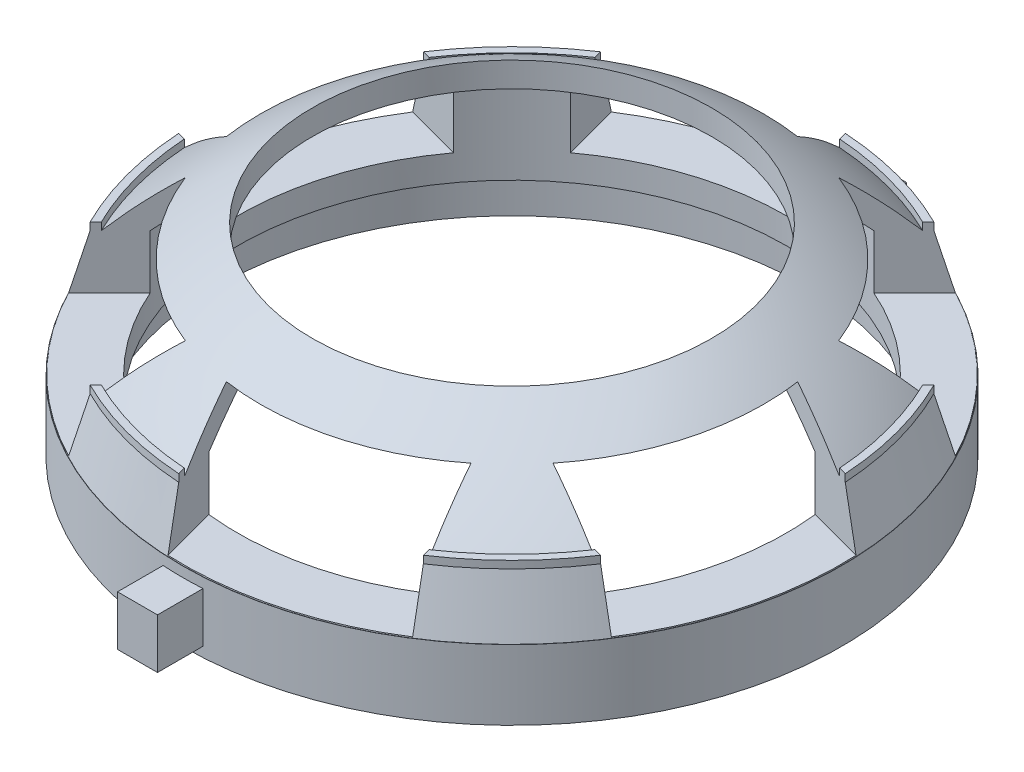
ISO-10303-21;
HEADER;
FILE_DESCRIPTION(('STEP AP214'),'2;1');
FILE_NAME('part.step','',(''),(''),'','','');
FILE_SCHEMA(('AUTOMOTIVE_DESIGN { 1 0 10303 214 1 1 1 1 }'));
ENDSEC;
DATA;
#1=APPLICATION_CONTEXT('core data for automotive mechanical design processes');
#2=APPLICATION_PROTOCOL_DEFINITION('international standard','automotive_design',2000,#1);
#3=PRODUCT_CONTEXT('',#1,'mechanical');
#4=PRODUCT('Part','Part','',(#3));
#5=PRODUCT_RELATED_PRODUCT_CATEGORY('part','',(#4));
#6=PRODUCT_DEFINITION_FORMATION('','',#4);
#7=PRODUCT_DEFINITION_CONTEXT('part definition',#1,'design');
#8=PRODUCT_DEFINITION('design','',#6,#7);
#9=PRODUCT_DEFINITION_SHAPE('','',#8);
#10=(LENGTH_UNIT() NAMED_UNIT(*) SI_UNIT(.MILLI.,.METRE.));
#11=(NAMED_UNIT(*) PLANE_ANGLE_UNIT() SI_UNIT($,.RADIAN.));
#12=(NAMED_UNIT(*) SI_UNIT($,.STERADIAN.) SOLID_ANGLE_UNIT());
#13=UNCERTAINTY_MEASURE_WITH_UNIT(LENGTH_MEASURE(1.E-05),#10,'distance_accuracy_value','');
#14=(GEOMETRIC_REPRESENTATION_CONTEXT(3) GLOBAL_UNCERTAINTY_ASSIGNED_CONTEXT((#13)) GLOBAL_UNIT_ASSIGNED_CONTEXT((#10,
#11,#12)) REPRESENTATION_CONTEXT('',''));
#15=CARTESIAN_POINT('',(0.,0.,0.));
#16=DIRECTION('',(0.,0.,1.));
#17=DIRECTION('',(1.,0.,0.));
#18=AXIS2_PLACEMENT_3D('',#15,#16,#17);
#19=CARTESIAN_POINT('',(0.,0.,0.));
#20=DIRECTION('',(0.,-1.,0.));
#21=DIRECTION('',(0.,0.,-1.));
#22=AXIS2_PLACEMENT_3D('',#19,#20,#21);
#23=CYLINDRICAL_SURFACE('',#22,6.3);
#24=DIRECTION('',(0.,-1.,0.));
#25=VECTOR('',#24,1.);
#26=CARTESIAN_POINT('',(-6.28818601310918,0.,0.385637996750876));
#27=LINE('',#26,#25);
#28=CARTESIAN_POINT('',(-6.28818601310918,2.5,0.385637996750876));
#29=VERTEX_POINT('',#28);
#30=CARTESIAN_POINT('',(-6.28818601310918,2.65,0.385637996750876));
#31=VERTEX_POINT('',#30);
#32=EDGE_CURVE('E1111',#29,#31,#27,.F.);
#33=ORIENTED_EDGE('',*,*,#32,.F.);
#34=CARTESIAN_POINT('',(0.,2.5,0.));
#35=DIRECTION('',(0.,-1.,0.));
#36=DIRECTION('',(0.,0.,-1.));
#37=AXIS2_PLACEMENT_3D('',#34,#35,#36);
#38=CIRCLE('',#37,6.3);
#39=CARTESIAN_POINT('',(-5.63854782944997,2.5,2.8101207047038));
#40=VERTEX_POINT('',#39);
#41=EDGE_CURVE('E693',#40,#29,#38,.T.);
#42=ORIENTED_EDGE('',*,*,#41,.F.);
#43=DIRECTION('',(0.,-1.,0.));
#44=VECTOR('',#43,1.);
#45=CARTESIAN_POINT('',(-5.63854782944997,0.,2.8101207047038));
#46=LINE('',#45,#44);
#47=CARTESIAN_POINT('',(-5.63854782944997,2.65,2.8101207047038));
#48=VERTEX_POINT('',#47);
#49=EDGE_CURVE('E929',#48,#40,#46,.T.);
#50=ORIENTED_EDGE('',*,*,#49,.F.);
#51=CARTESIAN_POINT('',(0.,2.65,0.));
#52=DIRECTION('',(0.,-1.,0.));
#53=DIRECTION('',(0.,0.,-1.));
#54=AXIS2_PLACEMENT_3D('',#51,#52,#53);
#55=CIRCLE('',#54,6.3);
#56=EDGE_CURVE('E688',#48,#31,#55,.T.);
#57=ORIENTED_EDGE('',*,*,#56,.T.);
#58=EDGE_LOOP('',(#33,#42,#50,#57));
#59=FACE_BOUND('',#58,.T.);
#60=ADVANCED_FACE('F39',(#59),#23,.T.);
#61=DIRECTION('',(0.,-1.,0.));
#62=VECTOR('',#61,1.);
#63=CARTESIAN_POINT('',(-5.2529098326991,0.,-3.4780653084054));
#64=LINE('',#63,#62);
#65=CARTESIAN_POINT('',(-5.2529098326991,2.65,-3.4780653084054));
#66=VERTEX_POINT('',#65);
#67=CARTESIAN_POINT('',(-5.2529098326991,2.5,-3.4780653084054));
#68=VERTEX_POINT('',#67);
#69=EDGE_CURVE('E563',#66,#68,#64,.T.);
#70=ORIENTED_EDGE('',*,*,#69,.F.);
#71=CARTESIAN_POINT('',(-3.47806530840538,2.65,-5.25290983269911));
#72=VERTEX_POINT('',#71);
#73=EDGE_CURVE('E692',#66,#72,#55,.T.);
#74=ORIENTED_EDGE('',*,*,#73,.T.);
#75=DIRECTION('',(0.,-1.,0.));
#76=VECTOR('',#75,1.);
#77=CARTESIAN_POINT('',(-3.47806530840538,0.,-5.25290983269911));
#78=LINE('',#77,#76);
#79=CARTESIAN_POINT('',(-3.47806530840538,2.5,-5.25290983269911));
#80=VERTEX_POINT('',#79);
#81=EDGE_CURVE('E843',#80,#72,#78,.F.);
#82=ORIENTED_EDGE('',*,*,#81,.F.);
#83=EDGE_CURVE('E697',#68,#80,#38,.T.);
#84=ORIENTED_EDGE('',*,*,#83,.F.);
#85=EDGE_LOOP('',(#70,#74,#82,#84));
#86=FACE_BOUND('',#85,.T.);
#87=ADVANCED_FACE('F884',(#86),#23,.T.);
#88=DIRECTION('',(0.,-1.,0.));
#89=VECTOR('',#88,1.);
#90=CARTESIAN_POINT('',(0.385637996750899,0.,-6.28818601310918));
#91=LINE('',#90,#89);
#92=CARTESIAN_POINT('',(0.385637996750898,2.65,-6.28818601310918));
#93=VERTEX_POINT('',#92);
#94=CARTESIAN_POINT('',(0.385637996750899,2.5,-6.28818601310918));
#95=VERTEX_POINT('',#94);
#96=EDGE_CURVE('E833',#93,#95,#91,.T.);
#97=ORIENTED_EDGE('',*,*,#96,.F.);
#98=CARTESIAN_POINT('',(2.81012070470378,2.65,-5.63854782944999));
#99=VERTEX_POINT('',#98);
#100=EDGE_CURVE('E889',#93,#99,#55,.T.);
#101=ORIENTED_EDGE('',*,*,#100,.T.);
#102=DIRECTION('',(0.,-1.,0.));
#103=VECTOR('',#102,1.);
#104=CARTESIAN_POINT('',(2.81012070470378,0.,-5.63854782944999));
#105=LINE('',#104,#103);
#106=CARTESIAN_POINT('',(2.81012070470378,2.5,-5.63854782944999));
#107=VERTEX_POINT('',#106);
#108=EDGE_CURVE('E1214',#107,#99,#105,.F.);
#109=ORIENTED_EDGE('',*,*,#108,.F.);
#110=EDGE_CURVE('E869',#95,#107,#38,.T.);
#111=ORIENTED_EDGE('',*,*,#110,.F.);
#112=EDGE_LOOP('',(#97,#101,#109,#111));
#113=FACE_BOUND('',#112,.T.);
#114=ADVANCED_FACE('F1020',(#113),#23,.T.);
#115=DIRECTION('',(0.,-1.,0.));
#116=VECTOR('',#115,1.);
#117=CARTESIAN_POINT('',(5.63854782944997,0.,-2.8101207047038));
#118=LINE('',#117,#116);
#119=CARTESIAN_POINT('',(5.63854782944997,2.65,-2.8101207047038));
#120=VERTEX_POINT('',#119);
#121=CARTESIAN_POINT('',(5.63854782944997,2.5,-2.8101207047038));
#122=VERTEX_POINT('',#121);
#123=EDGE_CURVE('E508',#120,#122,#118,.T.);
#124=ORIENTED_EDGE('',*,*,#123,.F.);
#125=CARTESIAN_POINT('',(6.28818601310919,2.65,-0.385637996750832));
#126=VERTEX_POINT('',#125);
#127=EDGE_CURVE('E891',#120,#126,#55,.T.);
#128=ORIENTED_EDGE('',*,*,#127,.T.);
#129=DIRECTION('',(0.,-1.,0.));
#130=VECTOR('',#129,1.);
#131=CARTESIAN_POINT('',(6.28818601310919,0.,-0.385637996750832));
#132=LINE('',#131,#130);
#133=CARTESIAN_POINT('',(6.28818601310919,2.5,-0.385637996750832));
#134=VERTEX_POINT('',#133);
#135=EDGE_CURVE('E499',#134,#126,#132,.F.);
#136=ORIENTED_EDGE('',*,*,#135,.F.);
#137=EDGE_CURVE('E867',#122,#134,#38,.T.);
#138=ORIENTED_EDGE('',*,*,#137,.F.);
#139=EDGE_LOOP('',(#124,#128,#136,#138));
#140=FACE_BOUND('',#139,.T.);
#141=ADVANCED_FACE('F1013',(#140),#23,.T.);
#142=DIRECTION('',(0.,-1.,0.));
#143=VECTOR('',#142,1.);
#144=CARTESIAN_POINT('',(-0.385637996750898,0.,6.28818601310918));
#145=LINE('',#144,#143);
#146=CARTESIAN_POINT('',(-0.385637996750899,2.65,6.28818601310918));
#147=VERTEX_POINT('',#146);
#148=CARTESIAN_POINT('',(-0.385637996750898,2.5,6.28818601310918));
#149=VERTEX_POINT('',#148);
#150=EDGE_CURVE('E554',#147,#149,#145,.T.);
#151=ORIENTED_EDGE('',*,*,#150,.F.);
#152=CARTESIAN_POINT('',(-2.81012070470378,2.65,5.63854782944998));
#153=VERTEX_POINT('',#152);
#154=EDGE_CURVE('E686',#147,#153,#55,.T.);
#155=ORIENTED_EDGE('',*,*,#154,.T.);
#156=DIRECTION('',(0.,-1.,0.));
#157=VECTOR('',#156,1.);
#158=CARTESIAN_POINT('',(-2.81012070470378,0.,5.63854782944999));
#159=LINE('',#158,#157);
#160=CARTESIAN_POINT('',(-2.81012070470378,2.5,5.63854782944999));
#161=VERTEX_POINT('',#160);
#162=EDGE_CURVE('E604',#161,#153,#159,.F.);
#163=ORIENTED_EDGE('',*,*,#162,.F.);
#164=EDGE_CURVE('E691',#149,#161,#38,.T.);
#165=ORIENTED_EDGE('',*,*,#164,.F.);
#166=EDGE_LOOP('',(#151,#155,#163,#165));
#167=FACE_BOUND('',#166,.T.);
#168=ADVANCED_FACE('F865',(#167),#23,.T.);
#169=CARTESIAN_POINT('',(6.15,2.65,0.));
#170=DIRECTION('',(0.,1.,0.));
#171=DIRECTION('',(0.,0.,1.));
#172=AXIS2_PLACEMENT_3D('',#169,#170,#171);
#173=PLANE('',#172);
#174=DIRECTION('',(0.965925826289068,0.,0.258819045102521));
#175=VECTOR('',#174,1.);
#176=CARTESIAN_POINT('',(5.2203900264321,2.65,3.46935165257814));
#177=LINE('',#176,#175);
#178=CARTESIAN_POINT('',(-6.13518400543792,2.65,0.426634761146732));
#179=VERTEX_POINT('',#178);
#180=EDGE_CURVE('E1114',#31,#179,#177,.T.);
#181=ORIENTED_EDGE('',*,*,#180,.F.);
#182=ORIENTED_EDGE('',*,*,#56,.F.);
#183=DIRECTION('',(-0.707106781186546,0.,0.707106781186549));
#184=VECTOR('',#183,1.);
#185=CARTESIAN_POINT('',(1.66078643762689,2.65,-4.48921356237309));
#186=LINE('',#185,#184);
#187=CARTESIAN_POINT('',(-5.52654258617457,2.65,2.69811546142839));
#188=VERTEX_POINT('',#187);
#189=EDGE_CURVE('E1102',#188,#48,#186,.T.);
#190=ORIENTED_EDGE('',*,*,#189,.F.);
#191=CARTESIAN_POINT('',(0.,2.65,0.));
#192=DIRECTION('',(0.,-1.,0.));
#193=DIRECTION('',(0.,0.,-1.));
#194=AXIS2_PLACEMENT_3D('',#191,#192,#193);
#195=CIRCLE('',#194,6.15);
#196=EDGE_CURVE('E683',#188,#179,#195,.T.);
#197=ORIENTED_EDGE('',*,*,#196,.T.);
#198=EDGE_LOOP('',(#181,#182,#190,#197));
#199=FACE_BOUND('',#198,.T.);
#200=ADVANCED_FACE('F1004',(#199),#173,.T.);
#201=DIRECTION('',(-0.965925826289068,0.,-0.258819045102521));
#202=VECTOR('',#201,1.);
#203=CARTESIAN_POINT('',(6.25566620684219,2.65,-0.394351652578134));
#204=LINE('',#203,#202);
#205=CARTESIAN_POINT('',(-5.09990782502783,2.65,-3.43706854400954));
#206=VERTEX_POINT('',#205);
#207=EDGE_CURVE('E561',#206,#66,#204,.T.);
#208=ORIENTED_EDGE('',*,*,#207,.F.);
#209=CARTESIAN_POINT('',(-3.43706854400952,2.65,-5.09990782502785));
#210=VERTEX_POINT('',#209);
#211=EDGE_CURVE('E687',#206,#210,#195,.T.);
#212=ORIENTED_EDGE('',*,*,#211,.T.);
#213=DIRECTION('',(0.258819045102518,0.,0.965925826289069));
#214=VECTOR('',#213,1.);
#215=CARTESIAN_POINT('',(-1.5198797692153,2.65,2.05513809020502));
#216=LINE('',#215,#214);
#217=EDGE_CURVE('E842',#72,#210,#216,.T.);
#218=ORIENTED_EDGE('',*,*,#217,.F.);
#219=ORIENTED_EDGE('',*,*,#73,.F.);
#220=EDGE_LOOP('',(#208,#212,#218,#219));
#221=FACE_BOUND('',#220,.T.);
#222=ADVANCED_FACE('F1018',(#221),#173,.T.);
#223=DIRECTION('',(-0.258819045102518,0.,-0.965925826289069));
#224=VECTOR('',#223,1.);
#225=CARTESIAN_POINT('',(2.34382353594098,2.65,1.01986190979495));
#226=LINE('',#225,#224);
#227=CARTESIAN_POINT('',(0.426634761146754,2.65,-6.13518400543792));
#228=VERTEX_POINT('',#227);
#229=EDGE_CURVE('E1208',#228,#93,#226,.T.);
#230=ORIENTED_EDGE('',*,*,#229,.F.);
#231=CARTESIAN_POINT('',(2.69811546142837,2.65,-5.52654258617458));
#232=VERTEX_POINT('',#231);
#233=EDGE_CURVE('E1169',#228,#232,#195,.T.);
#234=ORIENTED_EDGE('',*,*,#233,.T.);
#235=DIRECTION('',(-0.707106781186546,0.,0.707106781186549));
#236=VECTOR('',#235,1.);
#237=CARTESIAN_POINT('',(1.66078643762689,2.65,-4.48921356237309));
#238=LINE('',#237,#236);
#239=EDGE_CURVE('E1216',#99,#232,#238,.T.);
#240=ORIENTED_EDGE('',*,*,#239,.F.);
#241=ORIENTED_EDGE('',*,*,#100,.F.);
#242=EDGE_LOOP('',(#230,#234,#240,#241));
#243=FACE_BOUND('',#242,.T.);
#244=ADVANCED_FACE('F1258',(#243),#173,.T.);
#245=DIRECTION('',(0.707106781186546,0.,-0.707106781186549));
#246=VECTOR('',#245,1.);
#247=CARTESIAN_POINT('',(4.48921356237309,2.65,-1.66078643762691));
#248=LINE('',#247,#246);
#249=CARTESIAN_POINT('',(5.52654258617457,2.65,-2.69811546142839));
#250=VERTEX_POINT('',#249);
#251=EDGE_CURVE('E506',#250,#120,#248,.T.);
#252=ORIENTED_EDGE('',*,*,#251,.F.);
#253=CARTESIAN_POINT('',(6.13518400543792,2.65,-0.426634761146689));
#254=VERTEX_POINT('',#253);
#255=EDGE_CURVE('E1031',#250,#254,#195,.T.);
#256=ORIENTED_EDGE('',*,*,#255,.T.);
#257=DIRECTION('',(-0.965925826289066,0.,-0.258819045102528));
#258=VECTOR('',#257,1.);
#259=CARTESIAN_POINT('',(6.25566620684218,2.65,-0.394351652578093));
#260=LINE('',#259,#258);
#261=EDGE_CURVE('E1030',#126,#254,#260,.T.);
#262=ORIENTED_EDGE('',*,*,#261,.F.);
#263=ORIENTED_EDGE('',*,*,#127,.F.);
#264=EDGE_LOOP('',(#252,#256,#262,#263));
#265=FACE_BOUND('',#264,.T.);
#266=ADVANCED_FACE('F1027',(#265),#173,.T.);
#267=DIRECTION('',(0.258819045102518,0.,0.965925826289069));
#268=VECTOR('',#267,1.);
#269=CARTESIAN_POINT('',(-1.5198797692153,2.65,2.05513809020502));
#270=LINE('',#269,#268);
#271=CARTESIAN_POINT('',(-0.426634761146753,2.65,6.13518400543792));
#272=VERTEX_POINT('',#271);
#273=EDGE_CURVE('E857',#272,#147,#270,.T.);
#274=ORIENTED_EDGE('',*,*,#273,.F.);
#275=CARTESIAN_POINT('',(-2.69811546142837,2.65,5.52654258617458));
#276=VERTEX_POINT('',#275);
#277=EDGE_CURVE('E681',#272,#276,#195,.T.);
#278=ORIENTED_EDGE('',*,*,#277,.T.);
#279=DIRECTION('',(0.707106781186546,0.,-0.707106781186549));
#280=VECTOR('',#279,1.);
#281=CARTESIAN_POINT('',(4.48921356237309,2.65,-1.66078643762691));
#282=LINE('',#281,#280);
#283=EDGE_CURVE('E910',#153,#276,#282,.T.);
#284=ORIENTED_EDGE('',*,*,#283,.F.);
#285=ORIENTED_EDGE('',*,*,#154,.F.);
#286=EDGE_LOOP('',(#274,#278,#284,#285));
#287=FACE_BOUND('',#286,.T.);
#288=ADVANCED_FACE('F913',(#287),#173,.T.);
#289=CARTESIAN_POINT('',(0.,0.,0.));
#290=DIRECTION('',(0.,-1.,0.));
#291=DIRECTION('',(0.,0.,-1.));
#292=AXIS2_PLACEMENT_3D('',#289,#290,#291);
#293=CYLINDRICAL_SURFACE('',#292,6.15);
#294=DIRECTION('',(0.,-1.,0.));
#295=VECTOR('',#294,1.);
#296=CARTESIAN_POINT('',(-6.13518400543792,0.,0.426634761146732));
#297=LINE('',#296,#295);
#298=CARTESIAN_POINT('',(-6.13518400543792,2.5,0.426634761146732));
#299=VERTEX_POINT('',#298);
#300=EDGE_CURVE('E1118',#179,#299,#297,.T.);
#301=ORIENTED_EDGE('',*,*,#300,.F.);
#302=ORIENTED_EDGE('',*,*,#196,.F.);
#303=DIRECTION('',(0.,-1.,0.));
#304=VECTOR('',#303,1.);
#305=CARTESIAN_POINT('',(-5.52654258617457,0.,2.69811546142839));
#306=LINE('',#305,#304);
#307=CARTESIAN_POINT('',(-5.52654258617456,2.5,2.69811546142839));
#308=VERTEX_POINT('',#307);
#309=EDGE_CURVE('E1101',#308,#188,#306,.F.);
#310=ORIENTED_EDGE('',*,*,#309,.F.);
#311=CARTESIAN_POINT('',(0.,2.5,0.));
#312=DIRECTION('',(0.,-1.,0.));
#313=DIRECTION('',(0.,0.,-1.));
#314=AXIS2_PLACEMENT_3D('',#311,#312,#313);
#315=CIRCLE('',#314,6.15);
#316=EDGE_CURVE('E678',#308,#299,#315,.T.);
#317=ORIENTED_EDGE('',*,*,#316,.T.);
#318=EDGE_LOOP('',(#301,#302,#310,#317));
#319=FACE_BOUND('',#318,.T.);
#320=ADVANCED_FACE('F999',(#319),#293,.F.);
#321=DIRECTION('',(0.,-1.,0.));
#322=VECTOR('',#321,1.);
#323=CARTESIAN_POINT('',(-5.09990782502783,0.,-3.43706854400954));
#324=LINE('',#323,#322);
#325=CARTESIAN_POINT('',(-5.09990782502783,2.5,-3.43706854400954));
#326=VERTEX_POINT('',#325);
#327=EDGE_CURVE('E559',#326,#206,#324,.F.);
#328=ORIENTED_EDGE('',*,*,#327,.F.);
#329=CARTESIAN_POINT('',(-3.43706854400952,2.5,-5.09990782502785));
#330=VERTEX_POINT('',#329);
#331=EDGE_CURVE('E682',#326,#330,#315,.T.);
#332=ORIENTED_EDGE('',*,*,#331,.T.);
#333=DIRECTION('',(0.,-1.,0.));
#334=VECTOR('',#333,1.);
#335=CARTESIAN_POINT('',(-3.43706854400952,0.,-5.09990782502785));
#336=LINE('',#335,#334);
#337=EDGE_CURVE('E831',#210,#330,#336,.T.);
#338=ORIENTED_EDGE('',*,*,#337,.F.);
#339=ORIENTED_EDGE('',*,*,#211,.F.);
#340=EDGE_LOOP('',(#328,#332,#338,#339));
#341=FACE_BOUND('',#340,.T.);
#342=ADVANCED_FACE('F1180',(#341),#293,.F.);
#343=DIRECTION('',(0.,-1.,0.));
#344=VECTOR('',#343,1.);
#345=CARTESIAN_POINT('',(0.426634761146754,0.,-6.13518400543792));
#346=LINE('',#345,#344);
#347=CARTESIAN_POINT('',(0.426634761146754,2.5,-6.13518400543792));
#348=VERTEX_POINT('',#347);
#349=EDGE_CURVE('E1207',#348,#228,#346,.F.);
#350=ORIENTED_EDGE('',*,*,#349,.F.);
#351=CARTESIAN_POINT('',(2.69811546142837,2.5,-5.52654258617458));
#352=VERTEX_POINT('',#351);
#353=EDGE_CURVE('E1070',#348,#352,#315,.T.);
#354=ORIENTED_EDGE('',*,*,#353,.T.);
#355=DIRECTION('',(0.,-1.,0.));
#356=VECTOR('',#355,1.);
#357=CARTESIAN_POINT('',(2.69811546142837,0.,-5.52654258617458));
#358=LINE('',#357,#356);
#359=EDGE_CURVE('E1202',#232,#352,#358,.T.);
#360=ORIENTED_EDGE('',*,*,#359,.F.);
#361=ORIENTED_EDGE('',*,*,#233,.F.);
#362=EDGE_LOOP('',(#350,#354,#360,#361));
#363=FACE_BOUND('',#362,.T.);
#364=ADVANCED_FACE('F1206',(#363),#293,.F.);
#365=DIRECTION('',(0.,-1.,0.));
#366=VECTOR('',#365,1.);
#367=CARTESIAN_POINT('',(5.52654258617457,0.,-2.69811546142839));
#368=LINE('',#367,#366);
#369=CARTESIAN_POINT('',(5.52654258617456,2.5,-2.69811546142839));
#370=VERTEX_POINT('',#369);
#371=EDGE_CURVE('E504',#370,#250,#368,.F.);
#372=ORIENTED_EDGE('',*,*,#371,.F.);
#373=CARTESIAN_POINT('',(6.13518400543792,2.5,-0.426634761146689));
#374=VERTEX_POINT('',#373);
#375=EDGE_CURVE('E1068',#370,#374,#315,.T.);
#376=ORIENTED_EDGE('',*,*,#375,.T.);
#377=DIRECTION('',(0.,-1.,0.));
#378=VECTOR('',#377,1.);
#379=CARTESIAN_POINT('',(6.13518400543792,0.,-0.426634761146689));
#380=LINE('',#379,#378);
#381=EDGE_CURVE('E1033',#254,#374,#380,.T.);
#382=ORIENTED_EDGE('',*,*,#381,.F.);
#383=ORIENTED_EDGE('',*,*,#255,.F.);
#384=EDGE_LOOP('',(#372,#376,#382,#383));
#385=FACE_BOUND('',#384,.T.);
#386=ADVANCED_FACE('F1197',(#385),#293,.F.);
#387=DIRECTION('',(0.,-1.,0.));
#388=VECTOR('',#387,1.);
#389=CARTESIAN_POINT('',(-0.426634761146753,0.,6.13518400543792));
#390=LINE('',#389,#388);
#391=CARTESIAN_POINT('',(-0.426634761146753,2.5,6.13518400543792));
#392=VERTEX_POINT('',#391);
#393=EDGE_CURVE('E854',#392,#272,#390,.F.);
#394=ORIENTED_EDGE('',*,*,#393,.F.);
#395=CARTESIAN_POINT('',(-2.69811546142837,2.5,5.52654258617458));
#396=VERTEX_POINT('',#395);
#397=EDGE_CURVE('E677',#392,#396,#315,.T.);
#398=ORIENTED_EDGE('',*,*,#397,.T.);
#399=DIRECTION('',(0.,-1.,0.));
#400=VECTOR('',#399,1.);
#401=CARTESIAN_POINT('',(-2.69811546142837,0.,5.52654258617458));
#402=LINE('',#401,#400);
#403=EDGE_CURVE('E915',#276,#396,#402,.T.);
#404=ORIENTED_EDGE('',*,*,#403,.F.);
#405=ORIENTED_EDGE('',*,*,#277,.F.);
#406=EDGE_LOOP('',(#394,#398,#404,#405));
#407=FACE_BOUND('',#406,.T.);
#408=ADVANCED_FACE('F1000',(#407),#293,.F.);
#409=CARTESIAN_POINT('',(0.,0.,0.));
#410=DIRECTION('',(0.,-1.,0.));
#411=DIRECTION('',(0.,0.,-1.));
#412=AXIS2_PLACEMENT_3D('',#409,#410,#411);
#413=CYLINDRICAL_SURFACE('',#412,6.6);
#414=DIRECTION('',(0.,-1.,0.));
#415=VECTOR('',#414,1.);
#416=CARTESIAN_POINT('',(-0.4,0.,6.58786763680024));
#417=LINE('',#416,#415);
#418=CARTESIAN_POINT('',(-0.4,1.2,6.58786763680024));
#419=VERTEX_POINT('',#418);
#420=CARTESIAN_POINT('',(-0.4,0.2,6.58786763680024));
#421=VERTEX_POINT('',#420);
#422=EDGE_CURVE('E718',#419,#421,#417,.T.);
#423=ORIENTED_EDGE('',*,*,#422,.F.);
#424=CARTESIAN_POINT('',(0.,1.2,0.));
#425=DIRECTION('',(0.,1.,0.));
#426=DIRECTION('',(0.,0.,1.));
#427=AXIS2_PLACEMENT_3D('',#424,#425,#426);
#428=CIRCLE('',#427,6.6);
#429=CARTESIAN_POINT('',(0.4,1.2,6.58786763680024));
#430=VERTEX_POINT('',#429);
#431=EDGE_CURVE('E715',#430,#419,#428,.F.);
#432=ORIENTED_EDGE('',*,*,#431,.F.);
#433=DIRECTION('',(0.,-1.,0.));
#434=VECTOR('',#433,1.);
#435=CARTESIAN_POINT('',(0.4,0.,6.58786763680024));
#436=LINE('',#435,#434);
#437=CARTESIAN_POINT('',(0.4,0.2,6.58786763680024));
#438=VERTEX_POINT('',#437);
#439=EDGE_CURVE('E712',#438,#430,#436,.F.);
#440=ORIENTED_EDGE('',*,*,#439,.F.);
#441=CARTESIAN_POINT('',(0.,0.2,0.));
#442=DIRECTION('',(0.,-1.,0.));
#443=DIRECTION('',(0.,0.,-1.));
#444=AXIS2_PLACEMENT_3D('',#441,#442,#443);
#445=CIRCLE('',#444,6.6);
#446=EDGE_CURVE('E709',#421,#438,#445,.F.);
#447=ORIENTED_EDGE('',*,*,#446,.F.);
#448=EDGE_LOOP('',(#423,#432,#440,#447));
#449=FACE_BOUND('',#448,.T.);
#450=CARTESIAN_POINT('',(0.,1.4,0.));
#451=DIRECTION('',(0.,-1.,0.));
#452=DIRECTION('',(0.,0.,-1.));
#453=AXIS2_PLACEMENT_3D('',#450,#451,#452);
#454=CIRCLE('',#453,6.6);
#455=CARTESIAN_POINT('',(0.,1.4,-6.6));
#456=VERTEX_POINT('',#455);
#457=EDGE_CURVE('E700',#456,#456,#454,.T.);
#458=ORIENTED_EDGE('',*,*,#457,.T.);
#459=EDGE_LOOP('',(#458));
#460=FACE_BOUND('',#459,.T.);
#461=CARTESIAN_POINT('',(0.,0.,0.));
#462=DIRECTION('',(0.,-1.,0.));
#463=DIRECTION('',(0.,0.,-1.));
#464=AXIS2_PLACEMENT_3D('',#461,#462,#463);
#465=CIRCLE('',#464,6.6);
#466=CARTESIAN_POINT('',(0.,0.,-6.6));
#467=VERTEX_POINT('',#466);
#468=EDGE_CURVE('E703',#467,#467,#465,.T.);
#469=ORIENTED_EDGE('',*,*,#468,.F.);
#470=EDGE_LOOP('',(#469));
#471=FACE_BOUND('',#470,.T.);
#472=DIRECTION('',(0.,-1.,0.));
#473=VECTOR('',#472,1.);
#474=CARTESIAN_POINT('',(0.4,0.,-6.58786763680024));
#475=LINE('',#474,#473);
#476=CARTESIAN_POINT('',(0.4,1.2,-6.58786763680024));
#477=VERTEX_POINT('',#476);
#478=CARTESIAN_POINT('',(0.4,0.2,-6.58786763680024));
#479=VERTEX_POINT('',#478);
#480=EDGE_CURVE('E631',#477,#479,#475,.T.);
#481=ORIENTED_EDGE('',*,*,#480,.F.);
#482=CARTESIAN_POINT('',(0.,1.2,0.));
#483=DIRECTION('',(0.,-1.,0.));
#484=DIRECTION('',(0.,0.,-1.));
#485=AXIS2_PLACEMENT_3D('',#482,#483,#484);
#486=CIRCLE('',#485,6.6);
#487=CARTESIAN_POINT('',(-0.4,1.2,-6.58786763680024));
#488=VERTEX_POINT('',#487);
#489=EDGE_CURVE('E635',#488,#477,#486,.T.);
#490=ORIENTED_EDGE('',*,*,#489,.F.);
#491=DIRECTION('',(0.,-1.,0.));
#492=VECTOR('',#491,1.);
#493=CARTESIAN_POINT('',(-0.4,0.,-6.58786763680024));
#494=LINE('',#493,#492);
#495=CARTESIAN_POINT('',(-0.4,0.2,-6.58786763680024));
#496=VERTEX_POINT('',#495);
#497=EDGE_CURVE('E637',#496,#488,#494,.F.);
#498=ORIENTED_EDGE('',*,*,#497,.F.);
#499=CARTESIAN_POINT('',(0.,0.2,0.));
#500=DIRECTION('',(0.,1.,0.));
#501=DIRECTION('',(0.,0.,1.));
#502=AXIS2_PLACEMENT_3D('',#499,#500,#501);
#503=CIRCLE('',#502,6.6);
#504=EDGE_CURVE('E634',#479,#496,#503,.T.);
#505=ORIENTED_EDGE('',*,*,#504,.F.);
#506=EDGE_LOOP('',(#481,#490,#498,#505));
#507=FACE_BOUND('',#506,.T.);
#508=ADVANCED_FACE('F1436',(#449,#460,#471,#507),#413,.T.);
#509=CARTESIAN_POINT('',(0.,0.,0.));
#510=DIRECTION('',(0.,-1.,0.));
#511=DIRECTION('',(0.,0.,-1.));
#512=AXIS2_PLACEMENT_3D('',#509,#510,#511);
#513=CYLINDRICAL_SURFACE('',#512,5.9);
#514=CARTESIAN_POINT('',(0.,0.,0.));
#515=DIRECTION('',(0.,-1.,0.));
#516=DIRECTION('',(0.,0.,-1.));
#517=AXIS2_PLACEMENT_3D('',#514,#515,#516);
#518=CIRCLE('',#517,5.9);
#519=CARTESIAN_POINT('',(0.,0.,-5.9));
#520=VERTEX_POINT('',#519);
#521=EDGE_CURVE('E706',#520,#520,#518,.T.);
#522=ORIENTED_EDGE('',*,*,#521,.T.);
#523=EDGE_LOOP('',(#522));
#524=FACE_BOUND('',#523,.T.);
#525=CARTESIAN_POINT('',(0.,0.9,0.));
#526=DIRECTION('',(0.,-1.,0.));
#527=DIRECTION('',(0.,0.,-1.));
#528=AXIS2_PLACEMENT_3D('',#525,#526,#527);
#529=CIRCLE('',#528,5.9);
#530=CARTESIAN_POINT('',(0.,0.9,-5.9));
#531=VERTEX_POINT('',#530);
#532=EDGE_CURVE('E639',#531,#531,#529,.T.);
#533=ORIENTED_EDGE('',*,*,#532,.F.);
#534=EDGE_LOOP('',(#533));
#535=FACE_BOUND('',#534,.T.);
#536=ADVANCED_FACE('F41',(#524,#535),#513,.F.);
#537=CARTESIAN_POINT('',(5.9,0.,0.));
#538=DIRECTION('',(0.,-1.,0.));
#539=DIRECTION('',(0.,0.,-1.));
#540=AXIS2_PLACEMENT_3D('',#537,#538,#539);
#541=PLANE('',#540);
#542=ORIENTED_EDGE('',*,*,#468,.T.);
#543=EDGE_LOOP('',(#542));
#544=FACE_BOUND('',#543,.T.);
#545=ORIENTED_EDGE('',*,*,#521,.F.);
#546=EDGE_LOOP('',(#545));
#547=FACE_BOUND('',#546,.T.);
#548=ADVANCED_FACE('F1643',(#544,#547),#541,.T.);
#549=CARTESIAN_POINT('',(6.59474411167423,1.4,0.));
#550=DIRECTION('',(0.,1.,0.));
#551=DIRECTION('',(0.,0.,1.));
#552=AXIS2_PLACEMENT_3D('',#549,#550,#551);
#553=PLANE('',#552);
#554=CARTESIAN_POINT('',(0.,1.4,0.));
#555=DIRECTION('',(0.,-1.,0.));
#556=DIRECTION('',(0.,0.,-1.));
#557=AXIS2_PLACEMENT_3D('',#554,#555,#556);
#558=CIRCLE('',#557,6.59474411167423);
#559=CARTESIAN_POINT('',(0.,1.4,-6.59474411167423));
#560=VERTEX_POINT('',#559);
#561=EDGE_CURVE('E696',#560,#560,#558,.T.);
#562=ORIENTED_EDGE('',*,*,#561,.T.);
#563=EDGE_LOOP('',(#562));
#564=FACE_BOUND('',#563,.T.);
#565=ORIENTED_EDGE('',*,*,#457,.F.);
#566=EDGE_LOOP('',(#565));
#567=FACE_BOUND('',#566,.T.);
#568=ADVANCED_FACE('F1009',(#564,#567),#553,.T.);
#569=CARTESIAN_POINT('',(0.,1.4,0.));
#570=DIRECTION('',(0.,-1.,0.));
#571=DIRECTION('',(0.,0.,-1.));
#572=AXIS2_PLACEMENT_3D('',#569,#570,#571);
#573=CONICAL_SURFACE('',#572,6.59474411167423,0.261799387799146);
#574=CARTESIAN_POINT('',(-6.58229111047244,1.4198,0.306832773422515));
#575=CARTESIAN_POINT('',(-6.53337327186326,1.59989840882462,0.31994026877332));
#576=CARTESIAN_POINT('',(-6.48440104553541,1.77998094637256,0.333062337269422));
#577=CARTESIAN_POINT('',(-6.38634781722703,2.14011427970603,0.359335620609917));
#578=CARTESIAN_POINT('',(-6.33726681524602,2.32016507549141,0.372486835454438));
#579=CARTESIAN_POINT('',(-6.28813142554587,2.50019999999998,0.385652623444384));
#580=B_SPLINE_CURVE_WITH_KNOTS('',3,(#574,#575,#576,#577,#578,#579),.UNSPECIFIED.,.F.,.F.,(4,2,
4),(0.,0.561250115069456,1.1225002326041),.UNSPECIFIED.);
#581=CARTESIAN_POINT('',(-6.58223678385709,1.42,0.306847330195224));
#582=VERTEX_POINT('',#581);
#583=EDGE_CURVE('E1113',#582,#29,#580,.T.);
#584=ORIENTED_EDGE('',*,*,#583,.F.);
#585=CARTESIAN_POINT('',(0.,1.42,0.));
#586=DIRECTION('',(0.,-1.,0.));
#587=DIRECTION('',(0.,0.,-1.));
#588=AXIS2_PLACEMENT_3D('',#585,#586,#587);
#589=CIRCLE('',#588,6.58938512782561);
#590=CARTESIAN_POINT('',(-5.54696060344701,1.42,-3.55685597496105));
#591=VERTEX_POINT('',#590);
#592=EDGE_CURVE('E439',#591,#582,#589,.F.);
#593=ORIENTED_EDGE('',*,*,#592,.F.);
#594=CARTESIAN_POINT('',(-5.25285524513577,2.5002,-3.47805068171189));
#595=CARTESIAN_POINT('',(-5.30199063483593,2.32016507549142,-3.49121646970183));
#596=CARTESIAN_POINT('',(-5.35107163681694,2.14011427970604,-3.50436768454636));
#597=CARTESIAN_POINT('',(-5.44912486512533,1.77998094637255,-3.53064096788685));
#598=CARTESIAN_POINT('',(-5.49809709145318,1.5998984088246,-3.54376303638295));
#599=CARTESIAN_POINT('',(-5.54701493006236,1.41979999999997,-3.55687053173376));
#600=B_SPLINE_CURVE_WITH_KNOTS('',3,(#594,#595,#596,#597,#598,#599),.UNSPECIFIED.,.F.,.F.,(4,2,
4),(0.,0.561250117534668,1.12250023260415),.UNSPECIFIED.);
#601=EDGE_CURVE('E565',#68,#591,#600,.T.);
#602=ORIENTED_EDGE('',*,*,#601,.F.);
#603=ORIENTED_EDGE('',*,*,#83,.T.);
#604=CARTESIAN_POINT('',(-3.55687053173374,1.41979999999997,-5.54701493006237));
#605=CARTESIAN_POINT('',(-3.54376303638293,1.5998984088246,-5.49809709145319));
#606=CARTESIAN_POINT('',(-3.53064096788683,1.77998094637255,-5.44912486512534));
#607=CARTESIAN_POINT('',(-3.50436768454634,2.14011427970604,-5.35107163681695));
#608=CARTESIAN_POINT('',(-3.49121646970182,2.32016507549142,-5.30199063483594));
#609=CARTESIAN_POINT('',(-3.47805068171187,2.5002,-5.25285524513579));
#610=B_SPLINE_CURVE_WITH_KNOTS('',3,(#604,#605,#606,#607,#608,#609),.UNSPECIFIED.,.F.,.F.,(4,2,
4),(0.,0.561250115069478,1.12250023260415),.UNSPECIFIED.);
#611=CARTESIAN_POINT('',(-3.55685597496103,1.42,-5.54696060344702));
#612=VERTEX_POINT('',#611);
#613=EDGE_CURVE('E538',#612,#80,#610,.T.);
#614=ORIENTED_EDGE('',*,*,#613,.F.);
#615=CARTESIAN_POINT('',(0.306847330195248,1.42,-6.58223678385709));
#616=VERTEX_POINT('',#615);
#617=EDGE_CURVE('E1116',#616,#612,#589,.F.);
#618=ORIENTED_EDGE('',*,*,#617,.F.);
#619=CARTESIAN_POINT('',(0.385652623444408,2.5002,-6.28813142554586));
#620=CARTESIAN_POINT('',(0.372486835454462,2.32016507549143,-6.33726681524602));
#621=CARTESIAN_POINT('',(0.35933562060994,2.14011427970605,-6.38634781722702));
#622=CARTESIAN_POINT('',(0.333062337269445,1.77998094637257,-6.48440104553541));
#623=CARTESIAN_POINT('',(0.319940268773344,1.59989840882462,-6.53337327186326));
#624=CARTESIAN_POINT('',(0.306832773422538,1.4198,-6.58229111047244));
#625=B_SPLINE_CURVE_WITH_KNOTS('',3,(#619,#620,#621,#622,#623,#624),.UNSPECIFIED.,.F.,.F.,(4,2,
4),(0.,0.561250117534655,1.12250023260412),.UNSPECIFIED.);
#626=EDGE_CURVE('E829',#95,#616,#625,.T.);
#627=ORIENTED_EDGE('',*,*,#626,.F.);
#628=ORIENTED_EDGE('',*,*,#110,.T.);
#629=CARTESIAN_POINT('',(3.02542057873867,1.4198,-5.85384770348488));
#630=CARTESIAN_POINT('',(2.9896102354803,1.59989840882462,-5.8180373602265));
#631=CARTESIAN_POINT('',(2.95376007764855,1.77998094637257,-5.78218720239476));
#632=CARTESIAN_POINT('',(2.88198013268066,2.14011427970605,-5.71040725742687));
#633=CARTESIAN_POINT('',(2.84605034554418,2.32016507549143,-5.67447747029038));
#634=CARTESIAN_POINT('',(2.81008074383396,2.5002,-5.63850786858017));
#635=B_SPLINE_CURVE_WITH_KNOTS('',3,(#629,#630,#631,#632,#633,#634),.UNSPECIFIED.,.F.,.F.,(4,2,
4),(0.,0.561250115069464,1.12250023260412),.UNSPECIFIED.);
#636=CARTESIAN_POINT('',(3.02538080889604,1.42,-5.85380793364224));
#637=VERTEX_POINT('',#636);
#638=EDGE_CURVE('E1215',#637,#107,#635,.T.);
#639=ORIENTED_EDGE('',*,*,#638,.F.);
#640=CARTESIAN_POINT('',(5.85380793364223,1.42,-3.02538080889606));
#641=VERTEX_POINT('',#640);
#642=EDGE_CURVE('E1134',#641,#637,#589,.F.);
#643=ORIENTED_EDGE('',*,*,#642,.F.);
#644=CARTESIAN_POINT('',(5.63850786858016,2.5002,-2.81008074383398));
#645=CARTESIAN_POINT('',(5.67447747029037,2.32016507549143,-2.8460503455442));
#646=CARTESIAN_POINT('',(5.71040725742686,2.14011427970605,-2.88198013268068));
#647=CARTESIAN_POINT('',(5.78218720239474,1.77998094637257,-2.95376007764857));
#648=CARTESIAN_POINT('',(5.81803736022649,1.59989840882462,-2.98961023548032));
#649=CARTESIAN_POINT('',(5.85384770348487,1.4198,-3.02542057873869));
#650=B_SPLINE_CURVE_WITH_KNOTS('',3,(#644,#645,#646,#647,#648,#649),.UNSPECIFIED.,.F.,.F.,(4,2,
4),(0.,0.561250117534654,1.12250023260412),.UNSPECIFIED.);
#651=EDGE_CURVE('E510',#122,#641,#650,.T.);
#652=ORIENTED_EDGE('',*,*,#651,.F.);
#653=ORIENTED_EDGE('',*,*,#137,.T.);
#654=CARTESIAN_POINT('',(6.58229111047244,1.4198,-0.306832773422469));
#655=CARTESIAN_POINT('',(6.53337327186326,1.59989840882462,-0.319940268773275));
#656=CARTESIAN_POINT('',(6.48440104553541,1.77998094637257,-0.333062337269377));
#657=CARTESIAN_POINT('',(6.38634781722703,2.14011427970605,-0.359335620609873));
#658=CARTESIAN_POINT('',(6.33726681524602,2.32016507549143,-0.372486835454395));
#659=CARTESIAN_POINT('',(6.28813142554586,2.5002,-0.385652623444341));
#660=B_SPLINE_CURVE_WITH_KNOTS('',3,(#654,#655,#656,#657,#658,#659),.UNSPECIFIED.,.F.,.F.,(4,2,
4),(0.,0.561250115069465,1.12250023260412),.UNSPECIFIED.);
#661=CARTESIAN_POINT('',(6.58223678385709,1.42,-0.306847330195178));
#662=VERTEX_POINT('',#661);
#663=EDGE_CURVE('E491',#662,#134,#660,.T.);
#664=ORIENTED_EDGE('',*,*,#663,.F.);
#665=CARTESIAN_POINT('',(5.54696060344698,1.42,3.55685597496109));
#666=VERTEX_POINT('',#665);
#667=EDGE_CURVE('E440',#666,#662,#589,.F.);
#668=ORIENTED_EDGE('',*,*,#667,.F.);
#669=CARTESIAN_POINT('',(5.25285524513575,2.5002,3.47805068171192));
#670=CARTESIAN_POINT('',(5.30199063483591,2.32016507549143,3.49121646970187));
#671=CARTESIAN_POINT('',(5.35107163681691,2.14011427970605,3.50436768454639));
#672=CARTESIAN_POINT('',(5.4491248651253,1.77998094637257,3.53064096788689));
#673=CARTESIAN_POINT('',(5.49809709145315,1.59989840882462,3.54376303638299));
#674=CARTESIAN_POINT('',(5.54701493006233,1.4198,3.5568705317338));
#675=B_SPLINE_CURVE_WITH_KNOTS('',3,(#669,#670,#671,#672,#673,#674),.UNSPECIFIED.,.F.,.F.,(4,2,
4),(0.,0.561250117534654,1.12250023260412),.UNSPECIFIED.);
#676=CARTESIAN_POINT('',(5.25290983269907,2.5,3.47806530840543));
#677=VERTEX_POINT('',#676);
#678=EDGE_CURVE('E1039',#677,#666,#675,.T.);
#679=ORIENTED_EDGE('',*,*,#678,.F.);
#680=CARTESIAN_POINT('',(3.47806530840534,2.5,5.25290983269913));
#681=VERTEX_POINT('',#680);
#682=EDGE_CURVE('E457',#677,#681,#38,.T.);
#683=ORIENTED_EDGE('',*,*,#682,.T.);
#684=CARTESIAN_POINT('',(3.5568705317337,1.4198,5.54701493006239));
#685=CARTESIAN_POINT('',(3.54376303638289,1.59989840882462,5.49809709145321));
#686=CARTESIAN_POINT('',(3.53064096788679,1.77998094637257,5.44912486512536));
#687=CARTESIAN_POINT('',(3.5043676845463,2.14011427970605,5.35107163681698));
#688=CARTESIAN_POINT('',(3.49121646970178,2.32016507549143,5.30199063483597));
#689=CARTESIAN_POINT('',(3.47805068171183,2.5002,5.25285524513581));
#690=B_SPLINE_CURVE_WITH_KNOTS('',3,(#684,#685,#686,#687,#688,#689),.UNSPECIFIED.,.F.,.F.,(4,2,
4),(0.,0.561250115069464,1.12250023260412),.UNSPECIFIED.);
#691=CARTESIAN_POINT('',(3.55685597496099,1.42,5.54696060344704));
#692=VERTEX_POINT('',#691);
#693=EDGE_CURVE('E444',#692,#681,#690,.T.);
#694=ORIENTED_EDGE('',*,*,#693,.F.);
#695=CARTESIAN_POINT('',(-0.306847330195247,1.42,6.58223678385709));
#696=VERTEX_POINT('',#695);
#697=EDGE_CURVE('E429',#696,#692,#589,.F.);
#698=ORIENTED_EDGE('',*,*,#697,.F.);
#699=CARTESIAN_POINT('',(-0.385652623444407,2.5002,6.28813142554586));
#700=CARTESIAN_POINT('',(-0.372486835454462,2.32016507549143,6.33726681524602));
#701=CARTESIAN_POINT('',(-0.359335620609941,2.14011427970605,6.38634781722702));
#702=CARTESIAN_POINT('',(-0.333062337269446,1.77998094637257,6.48440104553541));
#703=CARTESIAN_POINT('',(-0.319940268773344,1.59989840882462,6.53337327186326));
#704=CARTESIAN_POINT('',(-0.306832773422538,1.4198,6.58229111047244));
#705=B_SPLINE_CURVE_WITH_KNOTS('',3,(#699,#700,#701,#702,#703,#704),.UNSPECIFIED.,.F.,.F.,(4,2,
4),(0.,0.561250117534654,1.12250023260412),.UNSPECIFIED.);
#706=EDGE_CURVE('E546',#149,#696,#705,.T.);
#707=ORIENTED_EDGE('',*,*,#706,.F.);
#708=ORIENTED_EDGE('',*,*,#164,.T.);
#709=CARTESIAN_POINT('',(-3.02542057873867,1.4198,5.85384770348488));
#710=CARTESIAN_POINT('',(-2.9896102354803,1.59989840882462,5.8180373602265));
#711=CARTESIAN_POINT('',(-2.95376007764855,1.77998094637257,5.78218720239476));
#712=CARTESIAN_POINT('',(-2.88198013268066,2.14011427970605,5.71040725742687));
#713=CARTESIAN_POINT('',(-2.84605034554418,2.32016507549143,5.67447747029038));
#714=CARTESIAN_POINT('',(-2.81008074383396,2.5002,5.63850786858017));
#715=B_SPLINE_CURVE_WITH_KNOTS('',3,(#709,#710,#711,#712,#713,#714),.UNSPECIFIED.,.F.,.F.,(4,2,
4),(0.,0.561250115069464,1.12250023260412),.UNSPECIFIED.);
#716=CARTESIAN_POINT('',(-3.02538080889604,1.42,5.85380793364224));
#717=VERTEX_POINT('',#716);
#718=EDGE_CURVE('E595',#717,#161,#715,.T.);
#719=ORIENTED_EDGE('',*,*,#718,.F.);
#720=CARTESIAN_POINT('',(0.,1.42,0.));
#721=DIRECTION('',(0.,-1.,0.));
#722=DIRECTION('',(1.,0.,0.));
#723=AXIS2_PLACEMENT_3D('',#720,#721,#722);
#724=CIRCLE('',#723,6.58938512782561);
#725=CARTESIAN_POINT('',(-5.85380793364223,1.42,3.02538080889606));
#726=VERTEX_POINT('',#725);
#727=EDGE_CURVE('E603',#726,#717,#724,.F.);
#728=ORIENTED_EDGE('',*,*,#727,.F.);
#729=CARTESIAN_POINT('',(-5.63850786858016,2.5002,2.81008074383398));
#730=CARTESIAN_POINT('',(-5.67447747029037,2.32016507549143,2.8460503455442));
#731=CARTESIAN_POINT('',(-5.71040725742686,2.14011427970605,2.88198013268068));
#732=CARTESIAN_POINT('',(-5.78218720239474,1.77998094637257,2.95376007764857));
#733=CARTESIAN_POINT('',(-5.81803736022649,1.59989840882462,2.98961023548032));
#734=CARTESIAN_POINT('',(-5.85384770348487,1.4198,3.02542057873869));
#735=B_SPLINE_CURVE_WITH_KNOTS('',3,(#729,#730,#731,#732,#733,#734),.UNSPECIFIED.,.F.,.F.,(4,2,
4),(0.,0.561250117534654,1.12250023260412),.UNSPECIFIED.);
#736=EDGE_CURVE('E923',#40,#726,#735,.T.);
#737=ORIENTED_EDGE('',*,*,#736,.F.);
#738=ORIENTED_EDGE('',*,*,#41,.T.);
#739=EDGE_LOOP('',(#584,#593,#602,#603,#614,#618,#627,#628,#639,#643,#652,#653,#664,#668,#679,
#683,#694,#698,#707,#708,#719,#728,#737,#738));
#740=FACE_BOUND('',#739,.T.);
#741=ORIENTED_EDGE('',*,*,#561,.F.);
#742=EDGE_LOOP('',(#741));
#743=FACE_BOUND('',#742,.T.);
#744=ADVANCED_FACE('F453',(#740,#743),#573,.T.);
#745=DIRECTION('',(0.,-1.,0.));
#746=VECTOR('',#745,1.);
#747=CARTESIAN_POINT('',(5.25290983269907,0.,3.47806530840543));
#748=LINE('',#747,#746);
#749=CARTESIAN_POINT('',(5.25290983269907,2.65,3.47806530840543));
#750=VERTEX_POINT('',#749);
#751=EDGE_CURVE('E1045',#750,#677,#748,.T.);
#752=ORIENTED_EDGE('',*,*,#751,.F.);
#753=CARTESIAN_POINT('',(3.47806530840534,2.65,5.25290983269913));
#754=VERTEX_POINT('',#753);
#755=EDGE_CURVE('E897',#750,#754,#55,.T.);
#756=ORIENTED_EDGE('',*,*,#755,.T.);
#757=DIRECTION('',(0.,-1.,0.));
#758=VECTOR('',#757,1.);
#759=CARTESIAN_POINT('',(3.47806530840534,0.,5.25290983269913));
#760=LINE('',#759,#758);
#761=EDGE_CURVE('E459',#681,#754,#760,.F.);
#762=ORIENTED_EDGE('',*,*,#761,.F.);
#763=ORIENTED_EDGE('',*,*,#682,.F.);
#764=EDGE_LOOP('',(#752,#756,#762,#763));
#765=FACE_BOUND('',#764,.T.);
#766=ADVANCED_FACE('F1002',(#765),#23,.T.);
#767=DIRECTION('',(0.965925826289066,0.,0.258819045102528));
#768=VECTOR('',#767,1.);
#769=CARTESIAN_POINT('',(5.22039002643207,2.65,3.46935165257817));
#770=LINE('',#769,#768);
#771=CARTESIAN_POINT('',(5.09990782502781,2.65,3.43706854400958));
#772=VERTEX_POINT('',#771);
#773=EDGE_CURVE('E1047',#772,#750,#770,.T.);
#774=ORIENTED_EDGE('',*,*,#773,.F.);
#775=CARTESIAN_POINT('',(3.43706854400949,2.65,5.09990782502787));
#776=VERTEX_POINT('',#775);
#777=EDGE_CURVE('E1062',#772,#776,#195,.T.);
#778=ORIENTED_EDGE('',*,*,#777,.T.);
#779=DIRECTION('',(-0.258819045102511,0.,-0.965925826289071));
#780=VECTOR('',#779,1.);
#781=CARTESIAN_POINT('',(2.34382353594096,2.65,1.01986190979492));
#782=LINE('',#781,#780);
#783=EDGE_CURVE('E463',#754,#776,#782,.T.);
#784=ORIENTED_EDGE('',*,*,#783,.F.);
#785=ORIENTED_EDGE('',*,*,#755,.F.);
#786=EDGE_LOOP('',(#774,#778,#784,#785));
#787=FACE_BOUND('',#786,.T.);
#788=ADVANCED_FACE('F997',(#787),#173,.T.);
#789=DIRECTION('',(0.,-1.,0.));
#790=VECTOR('',#789,1.);
#791=CARTESIAN_POINT('',(5.09990782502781,0.,3.43706854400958));
#792=LINE('',#791,#790);
#793=CARTESIAN_POINT('',(5.09990782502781,2.5,3.43706854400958));
#794=VERTEX_POINT('',#793);
#795=EDGE_CURVE('E1049',#794,#772,#792,.F.);
#796=ORIENTED_EDGE('',*,*,#795,.F.);
#797=CARTESIAN_POINT('',(3.43706854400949,2.5,5.09990782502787));
#798=VERTEX_POINT('',#797);
#799=EDGE_CURVE('E1060',#794,#798,#315,.T.);
#800=ORIENTED_EDGE('',*,*,#799,.T.);
#801=DIRECTION('',(0.,-1.,0.));
#802=VECTOR('',#801,1.);
#803=CARTESIAN_POINT('',(3.43706854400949,0.,5.09990782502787));
#804=LINE('',#803,#802);
#805=EDGE_CURVE('E1167',#776,#798,#804,.T.);
#806=ORIENTED_EDGE('',*,*,#805,.F.);
#807=ORIENTED_EDGE('',*,*,#777,.F.);
#808=EDGE_LOOP('',(#796,#800,#806,#807));
#809=FACE_BOUND('',#808,.T.);
#810=ADVANCED_FACE('F993',(#809),#293,.F.);
#811=CARTESIAN_POINT('',(0.,-3.79424340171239,0.));
#812=DIRECTION('',(0.,-1.,0.));
#813=DIRECTION('',(1.,0.,0.));
#814=AXIS2_PLACEMENT_3D('',#811,#812,#813);
#815=SPHERICAL_SURFACE('',#814,8.8);
#816=CARTESIAN_POINT('',(-0.517638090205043,-3.79424340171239,1.93185165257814));
#817=DIRECTION('',(-0.258819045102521,0.,0.965925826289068));
#818=DIRECTION('',(0.965925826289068,0.,0.258819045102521));
#819=AXIS2_PLACEMENT_3D('',#816,#817,#818);
#820=CIRCLE('',#819,8.56971411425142);
#821=CARTESIAN_POINT('',(-4.98546972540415,3.42,0.734699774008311));
#822=VERTEX_POINT('',#821);
#823=EDGE_CURVE('E1245',#299,#822,#820,.F.);
#824=ORIENTED_EDGE('',*,*,#823,.F.);
#825=ORIENTED_EDGE('',*,*,#316,.F.);
#826=CARTESIAN_POINT('',(-1.4142135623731,-3.79424340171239,-1.41421356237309));
#827=DIRECTION('',(-0.707106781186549,0.,-0.707106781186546));
#828=DIRECTION('',(-0.707106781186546,0.,0.707106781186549));
#829=AXIS2_PLACEMENT_3D('',#826,#827,#828);
#830=CIRCLE('',#829,8.56971411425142);
#831=CARTESIAN_POINT('',(-4.68489331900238,3.42,1.8564661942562));
#832=VERTEX_POINT('',#831);
#833=EDGE_CURVE('E1081',#832,#308,#830,.F.);
#834=ORIENTED_EDGE('',*,*,#833,.F.);
#835=CARTESIAN_POINT('',(0.,3.42,0.));
#836=DIRECTION('',(0.,1.,0.));
#837=DIRECTION('',(-1.,0.,0.));
#838=AXIS2_PLACEMENT_3D('',#835,#836,#837);
#839=CIRCLE('',#838,5.03931464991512);
#840=CARTESIAN_POINT('',(-1.85646619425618,3.42,4.68489331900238));
#841=VERTEX_POINT('',#840);
#842=EDGE_CURVE('E607',#841,#832,#839,.F.);
#843=ORIENTED_EDGE('',*,*,#842,.F.);
#844=CARTESIAN_POINT('',(1.4142135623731,-3.79424340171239,1.41421356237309));
#845=DIRECTION('',(0.707106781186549,0.,0.707106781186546));
#846=DIRECTION('',(0.707106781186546,0.,-0.707106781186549));
#847=AXIS2_PLACEMENT_3D('',#844,#845,#846);
#848=CIRCLE('',#847,8.56971411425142);
#849=EDGE_CURVE('E916',#396,#841,#848,.F.);
#850=ORIENTED_EDGE('',*,*,#849,.F.);
#851=ORIENTED_EDGE('',*,*,#397,.F.);
#852=CARTESIAN_POINT('',(-1.93185165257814,-3.79424340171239,0.517638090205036));
#853=DIRECTION('',(-0.965925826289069,0.,0.258819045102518));
#854=DIRECTION('',(0.258819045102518,0.,0.965925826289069));
#855=AXIS2_PLACEMENT_3D('',#852,#853,#854);
#856=CIRCLE('',#855,8.56971411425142);
#857=CARTESIAN_POINT('',(-0.734699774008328,3.42,4.98546972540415));
#858=VERTEX_POINT('',#857);
#859=EDGE_CURVE('E849',#858,#392,#856,.F.);
#860=ORIENTED_EDGE('',*,*,#859,.F.);
#861=CARTESIAN_POINT('',(0.,3.42,0.));
#862=DIRECTION('',(0.,1.,0.));
#863=DIRECTION('',(0.,0.,1.));
#864=AXIS2_PLACEMENT_3D('',#861,#862,#863);
#865=CIRCLE('',#864,5.03931464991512);
#866=CARTESIAN_POINT('',(3.12900353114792,3.42,3.95019354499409));
#867=VERTEX_POINT('',#866);
#868=EDGE_CURVE('E1132',#867,#858,#865,.F.);
#869=ORIENTED_EDGE('',*,*,#868,.F.);
#870=CARTESIAN_POINT('',(1.93185165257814,-3.79424340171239,-0.517638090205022));
#871=DIRECTION('',(0.965925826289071,0.,-0.258819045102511));
#872=DIRECTION('',(-0.258819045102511,0.,-0.965925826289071));
#873=AXIS2_PLACEMENT_3D('',#870,#871,#872);
#874=CIRCLE('',#873,8.56971411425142);
#875=EDGE_CURVE('E1067',#798,#867,#874,.F.);
#876=ORIENTED_EDGE('',*,*,#875,.F.);
#877=ORIENTED_EDGE('',*,*,#799,.F.);
#878=CARTESIAN_POINT('',(-0.517638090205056,-3.79424340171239,1.93185165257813));
#879=DIRECTION('',(-0.258819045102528,0.,0.965925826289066));
#880=DIRECTION('',(0.965925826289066,0.,0.258819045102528));
#881=AXIS2_PLACEMENT_3D('',#878,#879,#880);
#882=CIRCLE('',#881,8.56971411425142);
#883=CARTESIAN_POINT('',(3.95019354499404,3.42,3.12900353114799));
#884=VERTEX_POINT('',#883);
#885=EDGE_CURVE('E461',#884,#794,#882,.F.);
#886=ORIENTED_EDGE('',*,*,#885,.F.);
#887=CARTESIAN_POINT('',(4.98546972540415,3.42,-0.734699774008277));
#888=VERTEX_POINT('',#887);
#889=EDGE_CURVE('E1133',#888,#884,#865,.F.);
#890=ORIENTED_EDGE('',*,*,#889,.F.);
#891=CARTESIAN_POINT('',(0.517638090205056,-3.79424340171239,-1.93185165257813));
#892=DIRECTION('',(0.258819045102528,0.,-0.965925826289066));
#893=DIRECTION('',(-0.965925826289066,0.,-0.258819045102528));
#894=AXIS2_PLACEMENT_3D('',#891,#892,#893);
#895=CIRCLE('',#894,8.56971411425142);
#896=EDGE_CURVE('E1034',#374,#888,#895,.F.);
#897=ORIENTED_EDGE('',*,*,#896,.F.);
#898=ORIENTED_EDGE('',*,*,#375,.F.);
#899=CARTESIAN_POINT('',(1.4142135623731,-3.79424340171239,1.41421356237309));
#900=DIRECTION('',(0.707106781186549,0.,0.707106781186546));
#901=DIRECTION('',(0.707106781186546,0.,-0.707106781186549));
#902=AXIS2_PLACEMENT_3D('',#899,#900,#901);
#903=CIRCLE('',#902,8.56971411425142);
#904=CARTESIAN_POINT('',(4.68489331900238,3.42,-1.8564661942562));
#905=VERTEX_POINT('',#904);
#906=EDGE_CURVE('E502',#905,#370,#903,.F.);
#907=ORIENTED_EDGE('',*,*,#906,.F.);
#908=CARTESIAN_POINT('',(1.85646619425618,3.42,-4.68489331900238));
#909=VERTEX_POINT('',#908);
#910=EDGE_CURVE('E1188',#909,#905,#865,.F.);
#911=ORIENTED_EDGE('',*,*,#910,.F.);
#912=CARTESIAN_POINT('',(-1.4142135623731,-3.79424340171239,-1.41421356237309));
#913=DIRECTION('',(-0.707106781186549,0.,-0.707106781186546));
#914=DIRECTION('',(-0.707106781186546,0.,0.707106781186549));
#915=AXIS2_PLACEMENT_3D('',#912,#913,#914);
#916=CIRCLE('',#915,8.56971411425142);
#917=EDGE_CURVE('E1199',#352,#909,#916,.F.);
#918=ORIENTED_EDGE('',*,*,#917,.F.);
#919=ORIENTED_EDGE('',*,*,#353,.F.);
#920=CARTESIAN_POINT('',(1.93185165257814,-3.79424340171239,-0.517638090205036));
#921=DIRECTION('',(0.965925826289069,0.,-0.258819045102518));
#922=DIRECTION('',(-0.258819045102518,0.,-0.965925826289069));
#923=AXIS2_PLACEMENT_3D('',#920,#921,#922);
#924=CIRCLE('',#923,8.56971411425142);
#925=CARTESIAN_POINT('',(0.734699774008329,3.42,-4.98546972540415));
#926=VERTEX_POINT('',#925);
#927=EDGE_CURVE('E1187',#926,#348,#924,.F.);
#928=ORIENTED_EDGE('',*,*,#927,.F.);
#929=CARTESIAN_POINT('',(-3.12900353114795,3.42,-3.95019354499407));
#930=VERTEX_POINT('',#929);
#931=EDGE_CURVE('E1185',#930,#926,#865,.F.);
#932=ORIENTED_EDGE('',*,*,#931,.F.);
#933=CARTESIAN_POINT('',(-1.93185165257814,-3.79424340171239,0.517638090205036));
#934=DIRECTION('',(-0.965925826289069,0.,0.258819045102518));
#935=DIRECTION('',(0.258819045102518,0.,0.965925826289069));
#936=AXIS2_PLACEMENT_3D('',#933,#934,#935);
#937=CIRCLE('',#936,8.56971411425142);
#938=EDGE_CURVE('E823',#330,#930,#937,.F.);
#939=ORIENTED_EDGE('',*,*,#938,.F.);
#940=ORIENTED_EDGE('',*,*,#331,.F.);
#941=CARTESIAN_POINT('',(0.517638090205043,-3.79424340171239,-1.93185165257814));
#942=DIRECTION('',(0.258819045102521,0.,-0.965925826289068));
#943=DIRECTION('',(-0.965925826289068,0.,-0.258819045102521));
#944=AXIS2_PLACEMENT_3D('',#941,#942,#943);
#945=CIRCLE('',#944,8.56971411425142);
#946=CARTESIAN_POINT('',(-3.95019354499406,3.42,-3.12900353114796));
#947=VERTEX_POINT('',#946);
#948=EDGE_CURVE('E557',#947,#326,#945,.F.);
#949=ORIENTED_EDGE('',*,*,#948,.F.);
#950=EDGE_CURVE('E1098',#822,#947,#865,.F.);
#951=ORIENTED_EDGE('',*,*,#950,.F.);
#952=EDGE_LOOP('',(#824,#825,#834,#843,#850,#851,#860,#869,#876,#877,#886,#890,#897,#898,#907,
#911,#918,#919,#928,#932,#939,#940,#949,#951));
#953=FACE_BOUND('',#952,.T.);
#954=CARTESIAN_POINT('',(0.,4.04412377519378,0.));
#955=DIRECTION('',(0.,-1.,0.));
#956=DIRECTION('',(0.,0.,-1.));
#957=AXIS2_PLACEMENT_3D('',#954,#955,#956);
#958=CIRCLE('',#957,4.);
#959=CARTESIAN_POINT('',(0.,4.04412377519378,-4.));
#960=VERTEX_POINT('',#959);
#961=EDGE_CURVE('E674',#960,#960,#958,.T.);
#962=ORIENTED_EDGE('',*,*,#961,.T.);
#963=EDGE_LOOP('',(#962));
#964=FACE_BOUND('',#963,.T.);
#965=ADVANCED_FACE('F989',(#953,#964),#815,.T.);
#966=CARTESIAN_POINT('',(0.,0.,0.));
#967=DIRECTION('',(0.,-1.,0.));
#968=DIRECTION('',(0.,0.,-1.));
#969=AXIS2_PLACEMENT_3D('',#966,#967,#968);
#970=CYLINDRICAL_SURFACE('',#969,4.);
#971=CARTESIAN_POINT('',(0.,3.54520480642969,0.));
#972=DIRECTION('',(0.,-1.,0.));
#973=DIRECTION('',(0.,0.,-1.));
#974=AXIS2_PLACEMENT_3D('',#971,#972,#973);
#975=CIRCLE('',#974,4.);
#976=CARTESIAN_POINT('',(0.,3.54520480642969,-4.));
#977=VERTEX_POINT('',#976);
#978=EDGE_CURVE('E670',#977,#977,#975,.T.);
#979=ORIENTED_EDGE('',*,*,#978,.T.);
#980=EDGE_LOOP('',(#979));
#981=FACE_BOUND('',#980,.T.);
#982=ORIENTED_EDGE('',*,*,#961,.F.);
#983=EDGE_LOOP('',(#982));
#984=FACE_BOUND('',#983,.T.);
#985=ADVANCED_FACE('F986',(#981,#984),#970,.F.);
#986=CARTESIAN_POINT('',(0.,-3.79424340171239,0.));
#987=DIRECTION('',(0.,-1.,0.));
#988=DIRECTION('',(1.,0.,0.));
#989=AXIS2_PLACEMENT_3D('',#986,#987,#988);
#990=SPHERICAL_SURFACE('',#989,8.35867812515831);
#991=CARTESIAN_POINT('',(-0.517638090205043,-3.79424340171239,1.93185165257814));
#992=DIRECTION('',(-0.258819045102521,0.,0.965925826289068));
#993=DIRECTION('',(0.965925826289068,0.,0.258819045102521));
#994=AXIS2_PLACEMENT_3D('',#991,#992,#993);
#995=CIRCLE('',#994,8.11587949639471);
#996=CARTESIAN_POINT('',(-4.10877730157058,3.42,0.969608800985));
#997=VERTEX_POINT('',#996);
#998=CARTESIAN_POINT('',(-5.46653528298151,2.5,0.60579864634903));
#999=VERTEX_POINT('',#998);
#1000=EDGE_CURVE('E572',#997,#999,#995,.T.);
#1001=ORIENTED_EDGE('',*,*,#1000,.F.);
#1002=CARTESIAN_POINT('',(0.,3.42,0.));
#1003=DIRECTION('',(0.,1.,0.));
#1004=DIRECTION('',(0.,0.,1.));
#1005=AXIS2_PLACEMENT_3D('',#1002,#1003,#1004);
#1006=CIRCLE('',#1005,4.22163382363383);
#1007=CARTESIAN_POINT('',(-3.07350112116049,3.42,-2.89409450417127));
#1008=VERTEX_POINT('',#1007);
#1009=EDGE_CURVE('E11',#1008,#997,#1006,.T.);
#1010=ORIENTED_EDGE('',*,*,#1009,.F.);
#1011=CARTESIAN_POINT('',(0.517638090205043,-3.79424340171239,-1.93185165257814));
#1012=DIRECTION('',(0.258819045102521,0.,-0.965925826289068));
#1013=DIRECTION('',(-0.965925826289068,0.,-0.258819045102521));
#1014=AXIS2_PLACEMENT_3D('',#1011,#1012,#1013);
#1015=CIRCLE('',#1014,8.11587949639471);
#1016=CARTESIAN_POINT('',(-4.43125910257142,2.5,-3.25790465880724));
#1017=VERTEX_POINT('',#1016);
#1018=EDGE_CURVE('E553',#1017,#1008,#1015,.T.);
#1019=ORIENTED_EDGE('',*,*,#1018,.F.);
#1020=CARTESIAN_POINT('',(0.,2.5,0.));
#1021=DIRECTION('',(0.,-1.,0.));
#1022=DIRECTION('',(0.,0.,-1.));
#1023=AXIS2_PLACEMENT_3D('',#1020,#1021,#1022);
#1024=CIRCLE('',#1023,5.5);
#1025=CARTESIAN_POINT('',(-3.25790465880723,2.5,-4.43125910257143));
#1026=VERTEX_POINT('',#1025);
#1027=EDGE_CURVE('E671',#1017,#1026,#1024,.T.);
#1028=ORIENTED_EDGE('',*,*,#1027,.T.);
#1029=CARTESIAN_POINT('',(-1.93185165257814,-3.79424340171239,0.517638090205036));
#1030=DIRECTION('',(-0.965925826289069,0.,0.258819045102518));
#1031=DIRECTION('',(0.258819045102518,0.,0.965925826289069));
#1032=AXIS2_PLACEMENT_3D('',#1029,#1030,#1031);
#1033=CIRCLE('',#1032,8.11587949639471);
#1034=CARTESIAN_POINT('',(-2.89409450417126,3.42,-3.07350112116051));
#1035=VERTEX_POINT('',#1034);
#1036=EDGE_CURVE('E820',#1035,#1026,#1033,.T.);
#1037=ORIENTED_EDGE('',*,*,#1036,.F.);
#1038=CARTESIAN_POINT('',(0.969608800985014,3.42,-4.10877730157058));
#1039=VERTEX_POINT('',#1038);
#1040=EDGE_CURVE('E48',#1039,#1035,#1006,.T.);
#1041=ORIENTED_EDGE('',*,*,#1040,.F.);
#1042=CARTESIAN_POINT('',(1.93185165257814,-3.79424340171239,-0.517638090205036));
#1043=DIRECTION('',(0.965925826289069,0.,-0.258819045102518));
#1044=DIRECTION('',(-0.258819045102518,0.,-0.965925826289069));
#1045=AXIS2_PLACEMENT_3D('',#1042,#1043,#1044);
#1046=CIRCLE('',#1045,8.11587949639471);
#1047=CARTESIAN_POINT('',(0.60579864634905,2.5,-5.4665352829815));
#1048=VERTEX_POINT('',#1047);
#1049=EDGE_CURVE('E1211',#1048,#1039,#1046,.T.);
#1050=ORIENTED_EDGE('',*,*,#1049,.F.);
#1051=CARTESIAN_POINT('',(2.20863062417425,2.5,-5.03705774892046));
#1052=VERTEX_POINT('',#1051);
#1053=EDGE_CURVE('E1228',#1048,#1052,#1024,.T.);
#1054=ORIENTED_EDGE('',*,*,#1053,.T.);
#1055=CARTESIAN_POINT('',(-1.4142135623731,-3.79424340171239,-1.41421356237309));
#1056=DIRECTION('',(-0.707106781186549,0.,-0.707106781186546));
#1057=DIRECTION('',(-0.707106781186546,0.,0.707106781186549));
#1058=AXIS2_PLACEMENT_3D('',#1055,#1056,#1057);
#1059=CIRCLE('',#1058,8.11587949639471);
#1060=CARTESIAN_POINT('',(1.2146827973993,3.42,-4.0431099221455));
#1061=VERTEX_POINT('',#1060);
#1062=EDGE_CURVE('E517',#1061,#1052,#1059,.T.);
#1063=ORIENTED_EDGE('',*,*,#1062,.F.);
#1064=CARTESIAN_POINT('',(4.0431099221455,3.42,-1.21468279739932));
#1065=VERTEX_POINT('',#1064);
#1066=EDGE_CURVE('E806',#1065,#1061,#1006,.T.);
#1067=ORIENTED_EDGE('',*,*,#1066,.F.);
#1068=CARTESIAN_POINT('',(1.4142135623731,-3.79424340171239,1.41421356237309));
#1069=DIRECTION('',(0.707106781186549,0.,0.707106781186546));
#1070=DIRECTION('',(0.707106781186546,0.,-0.707106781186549));
#1071=AXIS2_PLACEMENT_3D('',#1068,#1069,#1070);
#1072=CIRCLE('',#1071,8.11587949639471);
#1073=CARTESIAN_POINT('',(5.03705774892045,2.5,-2.20863062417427));
#1074=VERTEX_POINT('',#1073);
#1075=EDGE_CURVE('E498',#1074,#1065,#1072,.T.);
#1076=ORIENTED_EDGE('',*,*,#1075,.F.);
#1077=CARTESIAN_POINT('',(5.46653528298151,2.5,-0.605798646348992));
#1078=VERTEX_POINT('',#1077);
#1079=EDGE_CURVE('E1230',#1074,#1078,#1024,.T.);
#1080=ORIENTED_EDGE('',*,*,#1079,.T.);
#1081=CARTESIAN_POINT('',(0.517638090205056,-3.79424340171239,-1.93185165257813));
#1082=DIRECTION('',(0.258819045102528,0.,-0.965925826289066));
#1083=DIRECTION('',(-0.965925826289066,0.,-0.258819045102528));
#1084=AXIS2_PLACEMENT_3D('',#1081,#1082,#1083);
#1085=CIRCLE('',#1084,8.11587949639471);
#1086=CARTESIAN_POINT('',(4.10877730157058,3.42,-0.969608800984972));
#1087=VERTEX_POINT('',#1086);
#1088=EDGE_CURVE('E802',#1087,#1078,#1085,.T.);
#1089=ORIENTED_EDGE('',*,*,#1088,.F.);
#1090=CARTESIAN_POINT('',(3.07350112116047,3.42,2.89409450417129));
#1091=VERTEX_POINT('',#1090);
#1092=EDGE_CURVE('E757',#1091,#1087,#1006,.T.);
#1093=ORIENTED_EDGE('',*,*,#1092,.F.);
#1094=CARTESIAN_POINT('',(-0.517638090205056,-3.79424340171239,1.93185165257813));
#1095=DIRECTION('',(-0.258819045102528,0.,0.965925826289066));
#1096=DIRECTION('',(0.965925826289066,0.,0.258819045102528));
#1097=AXIS2_PLACEMENT_3D('',#1094,#1095,#1096);
#1098=CIRCLE('',#1097,8.11587949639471);
#1099=CARTESIAN_POINT('',(4.4312591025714,2.5,3.25790465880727));
#1100=VERTEX_POINT('',#1099);
#1101=EDGE_CURVE('E458',#1100,#1091,#1098,.T.);
#1102=ORIENTED_EDGE('',*,*,#1101,.F.);
#1103=CARTESIAN_POINT('',(3.2579046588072,2.5,4.43125910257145));
#1104=VERTEX_POINT('',#1103);
#1105=EDGE_CURVE('E790',#1100,#1104,#1024,.T.);
#1106=ORIENTED_EDGE('',*,*,#1105,.T.);
#1107=CARTESIAN_POINT('',(1.93185165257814,-3.79424340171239,-0.517638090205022));
#1108=DIRECTION('',(0.965925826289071,0.,-0.258819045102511));
#1109=DIRECTION('',(-0.258819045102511,0.,-0.965925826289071));
#1110=AXIS2_PLACEMENT_3D('',#1107,#1108,#1109);
#1111=CIRCLE('',#1110,8.11587949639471);
#1112=CARTESIAN_POINT('',(2.89409450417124,3.42,3.07350112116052));
#1113=VERTEX_POINT('',#1112);
#1114=EDGE_CURVE('E1158',#1113,#1104,#1111,.T.);
#1115=ORIENTED_EDGE('',*,*,#1114,.F.);
#1116=CARTESIAN_POINT('',(-0.969608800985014,3.42,4.10877730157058));
#1117=VERTEX_POINT('',#1116);
#1118=EDGE_CURVE('E43',#1117,#1113,#1006,.T.);
#1119=ORIENTED_EDGE('',*,*,#1118,.F.);
#1120=CARTESIAN_POINT('',(-1.93185165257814,-3.79424340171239,0.517638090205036));
#1121=DIRECTION('',(-0.965925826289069,0.,0.258819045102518));
#1122=DIRECTION('',(0.258819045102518,0.,0.965925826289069));
#1123=AXIS2_PLACEMENT_3D('',#1120,#1121,#1122);
#1124=CIRCLE('',#1123,8.11587949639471);
#1125=CARTESIAN_POINT('',(-0.605798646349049,2.5,5.4665352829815));
#1126=VERTEX_POINT('',#1125);
#1127=EDGE_CURVE('E846',#1126,#1117,#1124,.T.);
#1128=ORIENTED_EDGE('',*,*,#1127,.F.);
#1129=CARTESIAN_POINT('',(-2.20863062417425,2.5,5.03705774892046));
#1130=VERTEX_POINT('',#1129);
#1131=EDGE_CURVE('E666',#1126,#1130,#1024,.T.);
#1132=ORIENTED_EDGE('',*,*,#1131,.T.);
#1133=CARTESIAN_POINT('',(1.4142135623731,-3.79424340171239,1.41421356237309));
#1134=DIRECTION('',(0.707106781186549,0.,0.707106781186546));
#1135=DIRECTION('',(0.707106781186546,0.,-0.707106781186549));
#1136=AXIS2_PLACEMENT_3D('',#1133,#1134,#1135);
#1137=CIRCLE('',#1136,8.11587949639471);
#1138=CARTESIAN_POINT('',(-1.2146827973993,3.42,4.0431099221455));
#1139=VERTEX_POINT('',#1138);
#1140=EDGE_CURVE('E920',#1139,#1130,#1137,.T.);
#1141=ORIENTED_EDGE('',*,*,#1140,.F.);
#1142=CARTESIAN_POINT('',(0.,3.42,0.));
#1143=DIRECTION('',(0.,1.,0.));
#1144=DIRECTION('',(-1.,0.,0.));
#1145=AXIS2_PLACEMENT_3D('',#1142,#1143,#1144);
#1146=CIRCLE('',#1145,4.22163382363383);
#1147=CARTESIAN_POINT('',(-4.0431099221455,3.42,1.21468279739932));
#1148=VERTEX_POINT('',#1147);
#1149=EDGE_CURVE('E728',#1148,#1139,#1146,.T.);
#1150=ORIENTED_EDGE('',*,*,#1149,.F.);
#1151=CARTESIAN_POINT('',(-1.4142135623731,-3.79424340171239,-1.41421356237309));
#1152=DIRECTION('',(-0.707106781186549,0.,-0.707106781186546));
#1153=DIRECTION('',(-0.707106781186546,0.,0.707106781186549));
#1154=AXIS2_PLACEMENT_3D('',#1151,#1152,#1153);
#1155=CIRCLE('',#1154,8.11587949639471);
#1156=CARTESIAN_POINT('',(-5.03705774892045,2.5,2.20863062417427));
#1157=VERTEX_POINT('',#1156);
#1158=EDGE_CURVE('E1091',#1157,#1148,#1155,.T.);
#1159=ORIENTED_EDGE('',*,*,#1158,.F.);
#1160=EDGE_CURVE('E667',#1157,#999,#1024,.T.);
#1161=ORIENTED_EDGE('',*,*,#1160,.T.);
#1162=EDGE_LOOP('',(#1001,#1010,#1019,#1028,#1037,#1041,#1050,#1054,#1063,#1067,#1076,#1080,
#1089,#1093,#1102,#1106,#1115,#1119,#1128,#1132,#1141,#1150,#1159,#1161));
#1163=FACE_BOUND('',#1162,.T.);
#1164=ORIENTED_EDGE('',*,*,#978,.F.);
#1165=EDGE_LOOP('',(#1164));
#1166=FACE_BOUND('',#1165,.T.);
#1167=ADVANCED_FACE('F797',(#1163,#1166),#990,.F.);
#1168=CARTESIAN_POINT('',(0.,0.,0.));
#1169=DIRECTION('',(0.,-1.,0.));
#1170=DIRECTION('',(0.,0.,-1.));
#1171=AXIS2_PLACEMENT_3D('',#1168,#1169,#1170);
#1172=CYLINDRICAL_SURFACE('',#1171,5.5);
#1173=DIRECTION('',(0.,-1.,0.));
#1174=VECTOR('',#1173,1.);
#1175=CARTESIAN_POINT('',(-5.46653528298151,0.,0.60579864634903));
#1176=LINE('',#1175,#1174);
#1177=CARTESIAN_POINT('',(-5.46653528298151,1.42,0.60579864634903));
#1178=VERTEX_POINT('',#1177);
#1179=EDGE_CURVE('E752',#999,#1178,#1176,.T.);
#1180=ORIENTED_EDGE('',*,*,#1179,.F.);
#1181=ORIENTED_EDGE('',*,*,#1160,.F.);
#1182=DIRECTION('',(0.,-1.,0.));
#1183=VECTOR('',#1182,1.);
#1184=CARTESIAN_POINT('',(-5.03705774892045,0.,2.20863062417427));
#1185=LINE('',#1184,#1183);
#1186=CARTESIAN_POINT('',(-5.03705774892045,1.42,2.20863062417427));
#1187=VERTEX_POINT('',#1186);
#1188=EDGE_CURVE('E721',#1187,#1157,#1185,.F.);
#1189=ORIENTED_EDGE('',*,*,#1188,.F.);
#1190=CARTESIAN_POINT('',(0.,1.42,0.));
#1191=DIRECTION('',(0.,-1.,0.));
#1192=DIRECTION('',(1.,0.,0.));
#1193=AXIS2_PLACEMENT_3D('',#1190,#1191,#1192);
#1194=CIRCLE('',#1193,5.5);
#1195=CARTESIAN_POINT('',(-2.20863062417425,1.42,5.03705774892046));
#1196=VERTEX_POINT('',#1195);
#1197=EDGE_CURVE('E723',#1196,#1187,#1194,.T.);
#1198=ORIENTED_EDGE('',*,*,#1197,.F.);
#1199=DIRECTION('',(0.,-1.,0.));
#1200=VECTOR('',#1199,1.);
#1201=CARTESIAN_POINT('',(-2.20863062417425,0.,5.03705774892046));
#1202=LINE('',#1201,#1200);
#1203=EDGE_CURVE('E726',#1130,#1196,#1202,.T.);
#1204=ORIENTED_EDGE('',*,*,#1203,.F.);
#1205=ORIENTED_EDGE('',*,*,#1131,.F.);
#1206=DIRECTION('',(0.,-1.,0.));
#1207=VECTOR('',#1206,1.);
#1208=CARTESIAN_POINT('',(-0.605798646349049,0.,5.4665352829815));
#1209=LINE('',#1208,#1207);
#1210=CARTESIAN_POINT('',(-0.605798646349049,1.42,5.4665352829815));
#1211=VERTEX_POINT('',#1210);
#1212=EDGE_CURVE('E733',#1211,#1126,#1209,.F.);
#1213=ORIENTED_EDGE('',*,*,#1212,.F.);
#1214=CARTESIAN_POINT('',(0.,1.42,0.));
#1215=DIRECTION('',(0.,-1.,0.));
#1216=DIRECTION('',(0.,0.,-1.));
#1217=AXIS2_PLACEMENT_3D('',#1214,#1215,#1216);
#1218=CIRCLE('',#1217,5.5);
#1219=CARTESIAN_POINT('',(3.2579046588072,1.42,4.43125910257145));
#1220=VERTEX_POINT('',#1219);
#1221=EDGE_CURVE('E731',#1220,#1211,#1218,.T.);
#1222=ORIENTED_EDGE('',*,*,#1221,.F.);
#1223=DIRECTION('',(0.,-1.,0.));
#1224=VECTOR('',#1223,1.);
#1225=CARTESIAN_POINT('',(3.2579046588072,0.,4.43125910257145));
#1226=LINE('',#1225,#1224);
#1227=EDGE_CURVE('E447',#1104,#1220,#1226,.T.);
#1228=ORIENTED_EDGE('',*,*,#1227,.F.);
#1229=ORIENTED_EDGE('',*,*,#1105,.F.);
#1230=DIRECTION('',(0.,-1.,0.));
#1231=VECTOR('',#1230,1.);
#1232=CARTESIAN_POINT('',(4.4312591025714,0.,3.25790465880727));
#1233=LINE('',#1232,#1231);
#1234=CARTESIAN_POINT('',(4.4312591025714,1.42,3.25790465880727));
#1235=VERTEX_POINT('',#1234);
#1236=EDGE_CURVE('E737',#1235,#1100,#1233,.F.);
#1237=ORIENTED_EDGE('',*,*,#1236,.F.);
#1238=CARTESIAN_POINT('',(5.46653528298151,1.42,-0.605798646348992));
#1239=VERTEX_POINT('',#1238);
#1240=EDGE_CURVE('E735',#1239,#1235,#1218,.T.);
#1241=ORIENTED_EDGE('',*,*,#1240,.F.);
#1242=DIRECTION('',(0.,-1.,0.));
#1243=VECTOR('',#1242,1.);
#1244=CARTESIAN_POINT('',(5.46653528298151,0.,-0.605798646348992));
#1245=LINE('',#1244,#1243);
#1246=EDGE_CURVE('E739',#1078,#1239,#1245,.T.);
#1247=ORIENTED_EDGE('',*,*,#1246,.F.);
#1248=ORIENTED_EDGE('',*,*,#1079,.F.);
#1249=DIRECTION('',(0.,-1.,0.));
#1250=VECTOR('',#1249,1.);
#1251=CARTESIAN_POINT('',(5.03705774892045,0.,-2.20863062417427));
#1252=LINE('',#1251,#1250);
#1253=CARTESIAN_POINT('',(5.03705774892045,1.42,-2.20863062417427));
#1254=VERTEX_POINT('',#1253);
#1255=EDGE_CURVE('E741',#1254,#1074,#1252,.F.);
#1256=ORIENTED_EDGE('',*,*,#1255,.F.);
#1257=CARTESIAN_POINT('',(2.20863062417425,1.42,-5.03705774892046));
#1258=VERTEX_POINT('',#1257);
#1259=EDGE_CURVE('E743',#1258,#1254,#1218,.T.);
#1260=ORIENTED_EDGE('',*,*,#1259,.F.);
#1261=DIRECTION('',(0.,-1.,0.));
#1262=VECTOR('',#1261,1.);
#1263=CARTESIAN_POINT('',(2.20863062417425,0.,-5.03705774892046));
#1264=LINE('',#1263,#1262);
#1265=EDGE_CURVE('E744',#1052,#1258,#1264,.T.);
#1266=ORIENTED_EDGE('',*,*,#1265,.F.);
#1267=ORIENTED_EDGE('',*,*,#1053,.F.);
#1268=DIRECTION('',(0.,-1.,0.));
#1269=VECTOR('',#1268,1.);
#1270=CARTESIAN_POINT('',(0.60579864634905,0.,-5.4665352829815));
#1271=LINE('',#1270,#1269);
#1272=CARTESIAN_POINT('',(0.60579864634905,1.42,-5.4665352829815));
#1273=VERTEX_POINT('',#1272);
#1274=EDGE_CURVE('E746',#1273,#1048,#1271,.F.);
#1275=ORIENTED_EDGE('',*,*,#1274,.F.);
#1276=CARTESIAN_POINT('',(-3.25790465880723,1.42,-4.43125910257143));
#1277=VERTEX_POINT('',#1276);
#1278=EDGE_CURVE('E748',#1277,#1273,#1218,.T.);
#1279=ORIENTED_EDGE('',*,*,#1278,.F.);
#1280=DIRECTION('',(0.,-1.,0.));
#1281=VECTOR('',#1280,1.);
#1282=CARTESIAN_POINT('',(-3.25790465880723,0.,-4.43125910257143));
#1283=LINE('',#1282,#1281);
#1284=EDGE_CURVE('E749',#1026,#1277,#1283,.T.);
#1285=ORIENTED_EDGE('',*,*,#1284,.F.);
#1286=ORIENTED_EDGE('',*,*,#1027,.F.);
#1287=DIRECTION('',(0.,-1.,0.));
#1288=VECTOR('',#1287,1.);
#1289=CARTESIAN_POINT('',(-4.43125910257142,0.,-3.25790465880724));
#1290=LINE('',#1289,#1288);
#1291=CARTESIAN_POINT('',(-4.43125910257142,1.42,-3.25790465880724));
#1292=VERTEX_POINT('',#1291);
#1293=EDGE_CURVE('E751',#1292,#1017,#1290,.F.);
#1294=ORIENTED_EDGE('',*,*,#1293,.F.);
#1295=EDGE_CURVE('E734',#1178,#1292,#1218,.T.);
#1296=ORIENTED_EDGE('',*,*,#1295,.F.);
#1297=EDGE_LOOP('',(#1180,#1181,#1189,#1198,#1204,#1205,#1213,#1222,#1228,#1229,#1237,#1241,
#1247,#1248,#1256,#1260,#1266,#1267,#1275,#1279,#1285,#1286,#1294,#1296));
#1298=FACE_BOUND('',#1297,.T.);
#1299=CARTESIAN_POINT('',(0.,0.9,0.));
#1300=DIRECTION('',(0.,-1.,0.));
#1301=DIRECTION('',(0.,0.,-1.));
#1302=AXIS2_PLACEMENT_3D('',#1299,#1300,#1301);
#1303=CIRCLE('',#1302,5.5);
#1304=CARTESIAN_POINT('',(0.,0.9,-5.5));
#1305=VERTEX_POINT('',#1304);
#1306=EDGE_CURVE('E663',#1305,#1305,#1303,.T.);
#1307=ORIENTED_EDGE('',*,*,#1306,.T.);
#1308=EDGE_LOOP('',(#1307));
#1309=FACE_BOUND('',#1308,.T.);
#1310=ADVANCED_FACE('F787',(#1298,#1309),#1172,.F.);
#1311=CARTESIAN_POINT('',(5.9,0.9,0.));
#1312=DIRECTION('',(0.,-1.,0.));
#1313=DIRECTION('',(0.,0.,-1.));
#1314=AXIS2_PLACEMENT_3D('',#1311,#1312,#1313);
#1315=PLANE('',#1314);
#1316=ORIENTED_EDGE('',*,*,#532,.T.);
#1317=EDGE_LOOP('',(#1316));
#1318=FACE_BOUND('',#1317,.T.);
#1319=ORIENTED_EDGE('',*,*,#1306,.F.);
#1320=EDGE_LOOP('',(#1319));
#1321=FACE_BOUND('',#1320,.T.);
#1322=ADVANCED_FACE('F963',(#1318,#1321),#1315,.T.);
#1323=CARTESIAN_POINT('',(0.,0.,-7.5));
#1324=DIRECTION('',(0.,0.,-1.));
#1325=DIRECTION('',(-1.,0.,0.));
#1326=AXIS2_PLACEMENT_3D('',#1323,#1324,#1325);
#1327=PLANE('',#1326);
#1328=DIRECTION('',(0.,-1.,0.));
#1329=VECTOR('',#1328,1.);
#1330=CARTESIAN_POINT('',(-0.4,0.2,-7.5));
#1331=LINE('',#1330,#1329);
#1332=CARTESIAN_POINT('',(-0.4,1.2,-7.5));
#1333=VERTEX_POINT('',#1332);
#1334=CARTESIAN_POINT('',(-0.4,0.2,-7.5));
#1335=VERTEX_POINT('',#1334);
#1336=EDGE_CURVE('E625',#1333,#1335,#1331,.T.);
#1337=ORIENTED_EDGE('',*,*,#1336,.F.);
#1338=DIRECTION('',(-1.,0.,0.));
#1339=VECTOR('',#1338,1.);
#1340=CARTESIAN_POINT('',(-0.4,1.2,-7.5));
#1341=LINE('',#1340,#1339);
#1342=CARTESIAN_POINT('',(0.4,1.2,-7.5));
#1343=VERTEX_POINT('',#1342);
#1344=EDGE_CURVE('E648',#1343,#1333,#1341,.T.);
#1345=ORIENTED_EDGE('',*,*,#1344,.F.);
#1346=DIRECTION('',(0.,1.,0.));
#1347=VECTOR('',#1346,1.);
#1348=CARTESIAN_POINT('',(0.4,0.2,-7.5));
#1349=LINE('',#1348,#1347);
#1350=CARTESIAN_POINT('',(0.4,0.2,-7.5));
#1351=VERTEX_POINT('',#1350);
#1352=EDGE_CURVE('E645',#1351,#1343,#1349,.T.);
#1353=ORIENTED_EDGE('',*,*,#1352,.F.);
#1354=DIRECTION('',(1.,0.,0.));
#1355=VECTOR('',#1354,1.);
#1356=CARTESIAN_POINT('',(-0.4,0.2,-7.5));
#1357=LINE('',#1356,#1355);
#1358=EDGE_CURVE('E642',#1335,#1351,#1357,.T.);
#1359=ORIENTED_EDGE('',*,*,#1358,.F.);
#1360=EDGE_LOOP('',(#1337,#1345,#1353,#1359));
#1361=FACE_BOUND('',#1360,.T.);
#1362=ADVANCED_FACE('F959',(#1361),#1327,.T.);
#1363=CARTESIAN_POINT('',(-0.4,1.2,6.601));
#1364=DIRECTION('',(0.,-1.,0.));
#1365=DIRECTION('',(0.,0.,-1.));
#1366=AXIS2_PLACEMENT_3D('',#1363,#1364,#1365);
#1367=PLANE('',#1366);
#1368=DIRECTION('',(0.,0.,-1.));
#1369=VECTOR('',#1368,1.);
#1370=CARTESIAN_POINT('',(-0.4,1.2,6.601));
#1371=LINE('',#1370,#1369);
#1372=EDGE_CURVE('E651',#488,#1333,#1371,.T.);
#1373=ORIENTED_EDGE('',*,*,#1372,.F.);
#1374=ORIENTED_EDGE('',*,*,#489,.T.);
#1375=DIRECTION('',(0.,0.,-1.));
#1376=VECTOR('',#1375,1.);
#1377=CARTESIAN_POINT('',(0.4,1.2,6.601));
#1378=LINE('',#1377,#1376);
#1379=EDGE_CURVE('E653',#477,#1343,#1378,.T.);
#1380=ORIENTED_EDGE('',*,*,#1379,.T.);
#1381=ORIENTED_EDGE('',*,*,#1344,.T.);
#1382=EDGE_LOOP('',(#1373,#1374,#1380,#1381));
#1383=FACE_BOUND('',#1382,.T.);
#1384=ADVANCED_FACE('F962',(#1383),#1367,.F.);
#1385=CARTESIAN_POINT('',(0.4,0.2,6.601));
#1386=DIRECTION('',(-1.,0.,0.));
#1387=DIRECTION('',(0.,-1.,0.));
#1388=AXIS2_PLACEMENT_3D('',#1385,#1386,#1387);
#1389=PLANE('',#1388);
#1390=ORIENTED_EDGE('',*,*,#1379,.F.);
#1391=ORIENTED_EDGE('',*,*,#480,.T.);
#1392=DIRECTION('',(0.,0.,-1.));
#1393=VECTOR('',#1392,1.);
#1394=CARTESIAN_POINT('',(0.4,0.2,6.601));
#1395=LINE('',#1394,#1393);
#1396=EDGE_CURVE('E655',#479,#1351,#1395,.T.);
#1397=ORIENTED_EDGE('',*,*,#1396,.T.);
#1398=ORIENTED_EDGE('',*,*,#1352,.T.);
#1399=EDGE_LOOP('',(#1390,#1391,#1397,#1398));
#1400=FACE_BOUND('',#1399,.T.);
#1401=ADVANCED_FACE('F967',(#1400),#1389,.F.);
#1402=CARTESIAN_POINT('',(-0.4,0.2,6.601));
#1403=DIRECTION('',(0.,1.,0.));
#1404=DIRECTION('',(0.,0.,1.));
#1405=AXIS2_PLACEMENT_3D('',#1402,#1403,#1404);
#1406=PLANE('',#1405);
#1407=ORIENTED_EDGE('',*,*,#1396,.F.);
#1408=ORIENTED_EDGE('',*,*,#504,.T.);
#1409=DIRECTION('',(0.,0.,-1.));
#1410=VECTOR('',#1409,1.);
#1411=CARTESIAN_POINT('',(-0.4,0.2,6.601));
#1412=LINE('',#1411,#1410);
#1413=EDGE_CURVE('E657',#496,#1335,#1412,.T.);
#1414=ORIENTED_EDGE('',*,*,#1413,.T.);
#1415=ORIENTED_EDGE('',*,*,#1358,.T.);
#1416=EDGE_LOOP('',(#1407,#1408,#1414,#1415));
#1417=FACE_BOUND('',#1416,.T.);
#1418=ADVANCED_FACE('F971',(#1417),#1406,.F.);
#1419=CARTESIAN_POINT('',(-0.4,0.2,6.601));
#1420=DIRECTION('',(1.,0.,0.));
#1421=DIRECTION('',(0.,1.,0.));
#1422=AXIS2_PLACEMENT_3D('',#1419,#1420,#1421);
#1423=PLANE('',#1422);
#1424=ORIENTED_EDGE('',*,*,#1413,.F.);
#1425=ORIENTED_EDGE('',*,*,#497,.T.);
#1426=ORIENTED_EDGE('',*,*,#1372,.T.);
#1427=ORIENTED_EDGE('',*,*,#1336,.T.);
#1428=EDGE_LOOP('',(#1424,#1425,#1426,#1427));
#1429=FACE_BOUND('',#1428,.T.);
#1430=ADVANCED_FACE('F957',(#1429),#1423,.F.);
#1431=CARTESIAN_POINT('',(-0.4,0.2,6.5));
#1432=DIRECTION('',(-1.,0.,0.));
#1433=DIRECTION('',(0.,0.,1.));
#1434=AXIS2_PLACEMENT_3D('',#1431,#1432,#1433);
#1435=PLANE('',#1434);
#1436=DIRECTION('',(0.,0.,1.));
#1437=VECTOR('',#1436,1.);
#1438=CARTESIAN_POINT('',(-0.4,1.2,6.5));
#1439=LINE('',#1438,#1437);
#1440=CARTESIAN_POINT('',(-0.4,1.2,7.5));
#1441=VERTEX_POINT('',#1440);
#1442=EDGE_CURVE('E623',#419,#1441,#1439,.T.);
#1443=ORIENTED_EDGE('',*,*,#1442,.F.);
#1444=ORIENTED_EDGE('',*,*,#422,.T.);
#1445=DIRECTION('',(0.,0.,1.));
#1446=VECTOR('',#1445,1.);
#1447=CARTESIAN_POINT('',(-0.4,0.2,6.5));
#1448=LINE('',#1447,#1446);
#1449=CARTESIAN_POINT('',(-0.4,0.2,7.5));
#1450=VERTEX_POINT('',#1449);
#1451=EDGE_CURVE('E622',#421,#1450,#1448,.T.);
#1452=ORIENTED_EDGE('',*,*,#1451,.T.);
#1453=DIRECTION('',(0.,-1.,0.));
#1454=VECTOR('',#1453,1.);
#1455=CARTESIAN_POINT('',(-0.4,0.2,7.5));
#1456=LINE('',#1455,#1454);
#1457=EDGE_CURVE('E610',#1441,#1450,#1456,.T.);
#1458=ORIENTED_EDGE('',*,*,#1457,.F.);
#1459=EDGE_LOOP('',(#1443,#1444,#1452,#1458));
#1460=FACE_BOUND('',#1459,.T.);
#1461=ADVANCED_FACE('F947',(#1460),#1435,.T.);
#1462=CARTESIAN_POINT('',(-0.4,1.2,6.5));
#1463=DIRECTION('',(0.,1.,0.));
#1464=DIRECTION('',(0.,0.,1.));
#1465=AXIS2_PLACEMENT_3D('',#1462,#1463,#1464);
#1466=PLANE('',#1465);
#1467=DIRECTION('',(0.,0.,1.));
#1468=VECTOR('',#1467,1.);
#1469=CARTESIAN_POINT('',(0.4,1.2,6.5));
#1470=LINE('',#1469,#1468);
#1471=CARTESIAN_POINT('',(0.4,1.2,7.5));
#1472=VERTEX_POINT('',#1471);
#1473=EDGE_CURVE('E626',#430,#1472,#1470,.T.);
#1474=ORIENTED_EDGE('',*,*,#1473,.F.);
#1475=ORIENTED_EDGE('',*,*,#431,.T.);
#1476=ORIENTED_EDGE('',*,*,#1442,.T.);
#1477=DIRECTION('',(-1.,0.,0.));
#1478=VECTOR('',#1477,1.);
#1479=CARTESIAN_POINT('',(-0.4,1.2,7.5));
#1480=LINE('',#1479,#1478);
#1481=EDGE_CURVE('E619',#1472,#1441,#1480,.T.);
#1482=ORIENTED_EDGE('',*,*,#1481,.F.);
#1483=EDGE_LOOP('',(#1474,#1475,#1476,#1482));
#1484=FACE_BOUND('',#1483,.T.);
#1485=ADVANCED_FACE('F943',(#1484),#1466,.T.);
#1486=CARTESIAN_POINT('',(0.4,0.2,6.5));
#1487=DIRECTION('',(1.,0.,0.));
#1488=DIRECTION('',(0.,0.,-1.));
#1489=AXIS2_PLACEMENT_3D('',#1486,#1487,#1488);
#1490=PLANE('',#1489);
#1491=DIRECTION('',(0.,0.,1.));
#1492=VECTOR('',#1491,1.);
#1493=CARTESIAN_POINT('',(0.4,0.2,6.5));
#1494=LINE('',#1493,#1492);
#1495=CARTESIAN_POINT('',(0.4,0.2,7.5));
#1496=VERTEX_POINT('',#1495);
#1497=EDGE_CURVE('E628',#438,#1496,#1494,.T.);
#1498=ORIENTED_EDGE('',*,*,#1497,.F.);
#1499=ORIENTED_EDGE('',*,*,#439,.T.);
#1500=ORIENTED_EDGE('',*,*,#1473,.T.);
#1501=DIRECTION('',(0.,1.,0.));
#1502=VECTOR('',#1501,1.);
#1503=CARTESIAN_POINT('',(0.4,0.2,7.5));
#1504=LINE('',#1503,#1502);
#1505=EDGE_CURVE('E616',#1496,#1472,#1504,.T.);
#1506=ORIENTED_EDGE('',*,*,#1505,.F.);
#1507=EDGE_LOOP('',(#1498,#1499,#1500,#1506));
#1508=FACE_BOUND('',#1507,.T.);
#1509=ADVANCED_FACE('F946',(#1508),#1490,.T.);
#1510=CARTESIAN_POINT('',(-0.4,0.2,6.5));
#1511=DIRECTION('',(0.,-1.,0.));
#1512=DIRECTION('',(0.,0.,-1.));
#1513=AXIS2_PLACEMENT_3D('',#1510,#1511,#1512);
#1514=PLANE('',#1513);
#1515=ORIENTED_EDGE('',*,*,#1451,.F.);
#1516=ORIENTED_EDGE('',*,*,#446,.T.);
#1517=ORIENTED_EDGE('',*,*,#1497,.T.);
#1518=DIRECTION('',(1.,0.,0.));
#1519=VECTOR('',#1518,1.);
#1520=CARTESIAN_POINT('',(-0.4,0.2,7.5));
#1521=LINE('',#1520,#1519);
#1522=EDGE_CURVE('E613',#1450,#1496,#1521,.T.);
#1523=ORIENTED_EDGE('',*,*,#1522,.F.);
#1524=EDGE_LOOP('',(#1515,#1516,#1517,#1523));
#1525=FACE_BOUND('',#1524,.T.);
#1526=ADVANCED_FACE('F941',(#1525),#1514,.T.);
#1527=CARTESIAN_POINT('',(0.,0.,7.5));
#1528=DIRECTION('',(0.,0.,-1.));
#1529=DIRECTION('',(-1.,0.,0.));
#1530=AXIS2_PLACEMENT_3D('',#1527,#1528,#1529);
#1531=PLANE('',#1530);
#1532=ORIENTED_EDGE('',*,*,#1457,.T.);
#1533=ORIENTED_EDGE('',*,*,#1522,.T.);
#1534=ORIENTED_EDGE('',*,*,#1505,.T.);
#1535=ORIENTED_EDGE('',*,*,#1481,.T.);
#1536=EDGE_LOOP('',(#1532,#1533,#1534,#1535));
#1537=FACE_BOUND('',#1536,.T.);
#1538=ADVANCED_FACE('F937',(#1537),#1531,.F.);
#1539=CARTESIAN_POINT('',(-5.65685424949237,1.42,8.48528137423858));
#1540=DIRECTION('',(0.,-1.,0.));
#1541=DIRECTION('',(1.,0.,0.));
#1542=AXIS2_PLACEMENT_3D('',#1539,#1540,#1541);
#1543=PLANE('',#1542);
#1544=ORIENTED_EDGE('',*,*,#727,.T.);
#1545=DIRECTION('',(0.707106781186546,0.,-0.707106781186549));
#1546=VECTOR('',#1545,1.);
#1547=CARTESIAN_POINT('',(-5.65685424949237,1.42,8.48528137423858));
#1548=LINE('',#1547,#1546);
#1549=EDGE_CURVE('E1088',#717,#1196,#1548,.T.);
#1550=ORIENTED_EDGE('',*,*,#1549,.T.);
#1551=ORIENTED_EDGE('',*,*,#1197,.T.);
#1552=DIRECTION('',(0.707106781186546,0.,-0.707106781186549));
#1553=VECTOR('',#1552,1.);
#1554=CARTESIAN_POINT('',(-8.48528137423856,1.42,5.6568542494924));
#1555=LINE('',#1554,#1553);
#1556=EDGE_CURVE('E1093',#726,#1187,#1555,.T.);
#1557=ORIENTED_EDGE('',*,*,#1556,.F.);
#1558=EDGE_LOOP('',(#1544,#1550,#1551,#1557));
#1559=FACE_BOUND('',#1558,.T.);
#1560=ADVANCED_FACE('F591',(#1559),#1543,.F.);
#1561=CARTESIAN_POINT('',(-5.65685424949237,1.42,8.48528137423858));
#1562=DIRECTION('',(0.707106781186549,0.,0.707106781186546));
#1563=DIRECTION('',(0.707106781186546,0.,-0.707106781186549));
#1564=AXIS2_PLACEMENT_3D('',#1561,#1562,#1563);
#1565=PLANE('',#1564);
#1566=ORIENTED_EDGE('',*,*,#718,.T.);
#1567=ORIENTED_EDGE('',*,*,#162,.T.);
#1568=ORIENTED_EDGE('',*,*,#283,.T.);
#1569=ORIENTED_EDGE('',*,*,#403,.T.);
#1570=ORIENTED_EDGE('',*,*,#849,.T.);
#1571=DIRECTION('',(0.707106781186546,0.,-0.707106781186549));
#1572=VECTOR('',#1571,1.);
#1573=CARTESIAN_POINT('',(-5.65685424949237,3.42,8.48528137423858));
#1574=LINE('',#1573,#1572);
#1575=EDGE_CURVE('E1086',#841,#1139,#1574,.T.);
#1576=ORIENTED_EDGE('',*,*,#1575,.T.);
#1577=ORIENTED_EDGE('',*,*,#1140,.T.);
#1578=ORIENTED_EDGE('',*,*,#1203,.T.);
#1579=ORIENTED_EDGE('',*,*,#1549,.F.);
#1580=EDGE_LOOP('',(#1566,#1567,#1568,#1569,#1570,#1576,#1577,#1578,#1579));
#1581=FACE_BOUND('',#1580,.T.);
#1582=ADVANCED_FACE('F586',(#1581),#1565,.F.);
#1583=CARTESIAN_POINT('',(-5.65685424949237,3.42,8.48528137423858));
#1584=DIRECTION('',(0.,1.,0.));
#1585=DIRECTION('',(-1.,0.,0.));
#1586=AXIS2_PLACEMENT_3D('',#1583,#1584,#1585);
#1587=PLANE('',#1586);
#1588=ORIENTED_EDGE('',*,*,#842,.T.);
#1589=DIRECTION('',(0.707106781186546,0.,-0.707106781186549));
#1590=VECTOR('',#1589,1.);
#1591=CARTESIAN_POINT('',(-8.48528137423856,3.42,5.6568542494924));
#1592=LINE('',#1591,#1590);
#1593=EDGE_CURVE('E1084',#832,#1148,#1592,.T.);
#1594=ORIENTED_EDGE('',*,*,#1593,.T.);
#1595=ORIENTED_EDGE('',*,*,#1149,.T.);
#1596=ORIENTED_EDGE('',*,*,#1575,.F.);
#1597=EDGE_LOOP('',(#1588,#1594,#1595,#1596));
#1598=FACE_BOUND('',#1597,.T.);
#1599=ADVANCED_FACE('F590',(#1598),#1587,.F.);
#1600=CARTESIAN_POINT('',(-8.48528137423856,1.42,5.6568542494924));
#1601=DIRECTION('',(-0.707106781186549,0.,-0.707106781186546));
#1602=DIRECTION('',(-0.707106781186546,0.,0.707106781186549));
#1603=AXIS2_PLACEMENT_3D('',#1600,#1601,#1602);
#1604=PLANE('',#1603);
#1605=ORIENTED_EDGE('',*,*,#736,.T.);
#1606=ORIENTED_EDGE('',*,*,#1556,.T.);
#1607=ORIENTED_EDGE('',*,*,#1188,.T.);
#1608=ORIENTED_EDGE('',*,*,#1158,.T.);
#1609=ORIENTED_EDGE('',*,*,#1593,.F.);
#1610=ORIENTED_EDGE('',*,*,#833,.T.);
#1611=ORIENTED_EDGE('',*,*,#309,.T.);
#1612=ORIENTED_EDGE('',*,*,#189,.T.);
#1613=ORIENTED_EDGE('',*,*,#49,.T.);
#1614=EDGE_LOOP('',(#1605,#1606,#1607,#1608,#1609,#1610,#1611,#1612,#1613));
#1615=FACE_BOUND('',#1614,.T.);
#1616=ADVANCED_FACE('F480',(#1615),#1604,.F.);
#1617=CARTESIAN_POINT('',(4.52004210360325,1.42,9.14162017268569));
#1618=DIRECTION('',(0.965925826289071,0.,-0.258819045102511));
#1619=DIRECTION('',(-0.258819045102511,0.,-0.965925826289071));
#1620=AXIS2_PLACEMENT_3D('',#1617,#1618,#1619);
#1621=PLANE('',#1620);
#1622=ORIENTED_EDGE('',*,*,#693,.T.);
#1623=ORIENTED_EDGE('',*,*,#761,.T.);
#1624=ORIENTED_EDGE('',*,*,#783,.T.);
#1625=ORIENTED_EDGE('',*,*,#805,.T.);
#1626=ORIENTED_EDGE('',*,*,#875,.T.);
#1627=DIRECTION('',(-0.258819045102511,0.,-0.965925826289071));
#1628=VECTOR('',#1627,1.);
#1629=CARTESIAN_POINT('',(4.52004210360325,3.42,9.14162017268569));
#1630=LINE('',#1629,#1628);
#1631=EDGE_CURVE('E449',#867,#1113,#1630,.T.);
#1632=ORIENTED_EDGE('',*,*,#1631,.T.);
#1633=ORIENTED_EDGE('',*,*,#1114,.T.);
#1634=ORIENTED_EDGE('',*,*,#1227,.T.);
#1635=DIRECTION('',(-0.258819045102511,0.,-0.965925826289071));
#1636=VECTOR('',#1635,1.);
#1637=CARTESIAN_POINT('',(4.52004210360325,1.42,9.14162017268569));
#1638=LINE('',#1637,#1636);
#1639=EDGE_CURVE('E432',#692,#1220,#1638,.T.);
#1640=ORIENTED_EDGE('',*,*,#1639,.F.);
#1641=EDGE_LOOP('',(#1622,#1623,#1624,#1625,#1626,#1632,#1633,#1634,#1640));
#1642=FACE_BOUND('',#1641,.T.);
#1643=ADVANCED_FACE('F443',(#1642),#1621,.F.);
#1644=CARTESIAN_POINT('',(-4.52004210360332,1.42,-9.14162017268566));
#1645=DIRECTION('',(-0.965925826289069,0.,0.258819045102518));
#1646=DIRECTION('',(0.258819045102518,0.,0.965925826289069));
#1647=AXIS2_PLACEMENT_3D('',#1644,#1645,#1646);
#1648=PLANE('',#1647);
#1649=ORIENTED_EDGE('',*,*,#706,.T.);
#1650=DIRECTION('',(0.258819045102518,0.,0.965925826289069));
#1651=VECTOR('',#1650,1.);
#1652=CARTESIAN_POINT('',(-4.52004210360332,1.42,-9.14162017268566));
#1653=LINE('',#1652,#1651);
#1654=EDGE_CURVE('E435',#1211,#696,#1653,.T.);
#1655=ORIENTED_EDGE('',*,*,#1654,.F.);
#1656=ORIENTED_EDGE('',*,*,#1212,.T.);
#1657=ORIENTED_EDGE('',*,*,#1127,.T.);
#1658=DIRECTION('',(0.258819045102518,0.,0.965925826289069));
#1659=VECTOR('',#1658,1.);
#1660=CARTESIAN_POINT('',(-4.52004210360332,3.42,-9.14162017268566));
#1661=LINE('',#1660,#1659);
#1662=EDGE_CURVE('E824',#1117,#858,#1661,.T.);
#1663=ORIENTED_EDGE('',*,*,#1662,.T.);
#1664=ORIENTED_EDGE('',*,*,#859,.T.);
#1665=ORIENTED_EDGE('',*,*,#393,.T.);
#1666=ORIENTED_EDGE('',*,*,#273,.T.);
#1667=ORIENTED_EDGE('',*,*,#150,.T.);
#1668=EDGE_LOOP('',(#1649,#1655,#1656,#1657,#1663,#1664,#1665,#1666,#1667));
#1669=FACE_BOUND('',#1668,.T.);
#1670=ADVANCED_FACE('F479',(#1669),#1648,.F.);
#1671=CARTESIAN_POINT('',(-10.1768963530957,1.42,-0.656338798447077));
#1672=DIRECTION('',(0.,-1.,0.));
#1673=DIRECTION('',(0.,0.,-1.));
#1674=AXIS2_PLACEMENT_3D('',#1671,#1672,#1673);
#1675=PLANE('',#1674);
#1676=ORIENTED_EDGE('',*,*,#697,.T.);
#1677=ORIENTED_EDGE('',*,*,#1639,.T.);
#1678=ORIENTED_EDGE('',*,*,#1221,.T.);
#1679=ORIENTED_EDGE('',*,*,#1654,.T.);
#1680=EDGE_LOOP('',(#1676,#1677,#1678,#1679));
#1681=FACE_BOUND('',#1680,.T.);
#1682=ADVANCED_FACE('F431',(#1681),#1675,.F.);
#1683=CARTESIAN_POINT('',(-10.1768963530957,3.42,-0.656338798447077));
#1684=DIRECTION('',(0.,1.,0.));
#1685=DIRECTION('',(0.,0.,1.));
#1686=AXIS2_PLACEMENT_3D('',#1683,#1684,#1685);
#1687=PLANE('',#1686);
#1688=ORIENTED_EDGE('',*,*,#868,.T.);
#1689=ORIENTED_EDGE('',*,*,#1662,.F.);
#1690=ORIENTED_EDGE('',*,*,#1118,.T.);
#1691=ORIENTED_EDGE('',*,*,#1631,.F.);
#1692=EDGE_LOOP('',(#1688,#1689,#1690,#1691));
#1693=FACE_BOUND('',#1692,.T.);
#1694=ADVANCED_FACE('F486',(#1693),#1687,.F.);
#1695=CARTESIAN_POINT('',(10.1768963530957,1.42,0.656338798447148));
#1696=DIRECTION('',(0.258819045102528,0.,-0.965925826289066));
#1697=DIRECTION('',(-0.965925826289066,0.,-0.258819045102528));
#1698=AXIS2_PLACEMENT_3D('',#1695,#1696,#1697);
#1699=PLANE('',#1698);
#1700=ORIENTED_EDGE('',*,*,#663,.T.);
#1701=ORIENTED_EDGE('',*,*,#135,.T.);
#1702=ORIENTED_EDGE('',*,*,#261,.T.);
#1703=ORIENTED_EDGE('',*,*,#381,.T.);
#1704=ORIENTED_EDGE('',*,*,#896,.T.);
#1705=DIRECTION('',(-0.965925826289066,0.,-0.258819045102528));
#1706=VECTOR('',#1705,1.);
#1707=CARTESIAN_POINT('',(10.1768963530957,3.42,0.656338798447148));
#1708=LINE('',#1707,#1706);
#1709=EDGE_CURVE('E1138',#888,#1087,#1708,.T.);
#1710=ORIENTED_EDGE('',*,*,#1709,.T.);
#1711=ORIENTED_EDGE('',*,*,#1088,.T.);
#1712=ORIENTED_EDGE('',*,*,#1246,.T.);
#1713=DIRECTION('',(-0.965925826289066,0.,-0.258819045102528));
#1714=VECTOR('',#1713,1.);
#1715=CARTESIAN_POINT('',(10.1768963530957,1.42,0.656338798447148));
#1716=LINE('',#1715,#1714);
#1717=EDGE_CURVE('E783',#662,#1239,#1716,.T.);
#1718=ORIENTED_EDGE('',*,*,#1717,.F.);
#1719=EDGE_LOOP('',(#1700,#1701,#1702,#1703,#1704,#1710,#1711,#1712,#1718));
#1720=FACE_BOUND('',#1719,.T.);
#1721=ADVANCED_FACE('F481',(#1720),#1699,.F.);
#1722=CARTESIAN_POINT('',(9.14162017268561,1.42,4.52004210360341));
#1723=DIRECTION('',(-0.258819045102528,0.,0.965925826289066));
#1724=DIRECTION('',(0.965925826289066,0.,0.258819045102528));
#1725=AXIS2_PLACEMENT_3D('',#1722,#1723,#1724);
#1726=PLANE('',#1725);
#1727=ORIENTED_EDGE('',*,*,#678,.T.);
#1728=DIRECTION('',(-0.965925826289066,0.,-0.258819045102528));
#1729=VECTOR('',#1728,1.);
#1730=CARTESIAN_POINT('',(9.14162017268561,1.42,4.52004210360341));
#1731=LINE('',#1730,#1729);
#1732=EDGE_CURVE('E448',#666,#1235,#1731,.T.);
#1733=ORIENTED_EDGE('',*,*,#1732,.T.);
#1734=ORIENTED_EDGE('',*,*,#1236,.T.);
#1735=ORIENTED_EDGE('',*,*,#1101,.T.);
#1736=DIRECTION('',(-0.965925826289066,0.,-0.258819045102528));
#1737=VECTOR('',#1736,1.);
#1738=CARTESIAN_POINT('',(9.14162017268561,3.42,4.52004210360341));
#1739=LINE('',#1738,#1737);
#1740=EDGE_CURVE('E1053',#884,#1091,#1739,.T.);
#1741=ORIENTED_EDGE('',*,*,#1740,.F.);
#1742=ORIENTED_EDGE('',*,*,#885,.T.);
#1743=ORIENTED_EDGE('',*,*,#795,.T.);
#1744=ORIENTED_EDGE('',*,*,#773,.T.);
#1745=ORIENTED_EDGE('',*,*,#751,.T.);
#1746=EDGE_LOOP('',(#1727,#1733,#1734,#1735,#1741,#1742,#1743,#1744,#1745));
#1747=FACE_BOUND('',#1746,.T.);
#1748=ADVANCED_FACE('F485',(#1747),#1726,.F.);
#1749=ORIENTED_EDGE('',*,*,#667,.T.);
#1750=ORIENTED_EDGE('',*,*,#1717,.T.);
#1751=ORIENTED_EDGE('',*,*,#1240,.T.);
#1752=ORIENTED_EDGE('',*,*,#1732,.F.);
#1753=EDGE_LOOP('',(#1749,#1750,#1751,#1752));
#1754=FACE_BOUND('',#1753,.T.);
#1755=ADVANCED_FACE('F780',(#1754),#1675,.F.);
#1756=ORIENTED_EDGE('',*,*,#889,.T.);
#1757=ORIENTED_EDGE('',*,*,#1740,.T.);
#1758=ORIENTED_EDGE('',*,*,#1092,.T.);
#1759=ORIENTED_EDGE('',*,*,#1709,.F.);
#1760=EDGE_LOOP('',(#1756,#1757,#1758,#1759));
#1761=FACE_BOUND('',#1760,.T.);
#1762=ADVANCED_FACE('F1192',(#1761),#1687,.F.);
#1763=CARTESIAN_POINT('',(5.65685424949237,1.42,-8.48528137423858));
#1764=DIRECTION('',(-0.707106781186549,0.,-0.707106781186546));
#1765=DIRECTION('',(-0.707106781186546,0.,0.707106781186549));
#1766=AXIS2_PLACEMENT_3D('',#1763,#1764,#1765);
#1767=PLANE('',#1766);
#1768=ORIENTED_EDGE('',*,*,#638,.T.);
#1769=ORIENTED_EDGE('',*,*,#108,.T.);
#1770=ORIENTED_EDGE('',*,*,#239,.T.);
#1771=ORIENTED_EDGE('',*,*,#359,.T.);
#1772=ORIENTED_EDGE('',*,*,#917,.T.);
#1773=DIRECTION('',(-0.707106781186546,0.,0.707106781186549));
#1774=VECTOR('',#1773,1.);
#1775=CARTESIAN_POINT('',(5.65685424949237,3.42,-8.48528137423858));
#1776=LINE('',#1775,#1774);
#1777=EDGE_CURVE('E1150',#909,#1061,#1776,.T.);
#1778=ORIENTED_EDGE('',*,*,#1777,.T.);
#1779=ORIENTED_EDGE('',*,*,#1062,.T.);
#1780=ORIENTED_EDGE('',*,*,#1265,.T.);
#1781=DIRECTION('',(-0.707106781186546,0.,0.707106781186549));
#1782=VECTOR('',#1781,1.);
#1783=CARTESIAN_POINT('',(5.65685424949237,1.42,-8.48528137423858));
#1784=LINE('',#1783,#1782);
#1785=EDGE_CURVE('E1147',#637,#1258,#1784,.T.);
#1786=ORIENTED_EDGE('',*,*,#1785,.F.);
#1787=EDGE_LOOP('',(#1768,#1769,#1770,#1771,#1772,#1778,#1779,#1780,#1786));
#1788=FACE_BOUND('',#1787,.T.);
#1789=ADVANCED_FACE('F524',(#1788),#1767,.F.);
#1790=CARTESIAN_POINT('',(8.48528137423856,1.42,-5.6568542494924));
#1791=DIRECTION('',(0.707106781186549,0.,0.707106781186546));
#1792=DIRECTION('',(0.707106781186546,0.,-0.707106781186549));
#1793=AXIS2_PLACEMENT_3D('',#1790,#1791,#1792);
#1794=PLANE('',#1793);
#1795=ORIENTED_EDGE('',*,*,#651,.T.);
#1796=DIRECTION('',(-0.707106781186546,0.,0.707106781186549));
#1797=VECTOR('',#1796,1.);
#1798=CARTESIAN_POINT('',(8.48528137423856,1.42,-5.6568542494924));
#1799=LINE('',#1798,#1797);
#1800=EDGE_CURVE('E1137',#641,#1254,#1799,.T.);
#1801=ORIENTED_EDGE('',*,*,#1800,.T.);
#1802=ORIENTED_EDGE('',*,*,#1255,.T.);
#1803=ORIENTED_EDGE('',*,*,#1075,.T.);
#1804=DIRECTION('',(-0.707106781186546,0.,0.707106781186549));
#1805=VECTOR('',#1804,1.);
#1806=CARTESIAN_POINT('',(8.48528137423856,3.42,-5.6568542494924));
#1807=LINE('',#1806,#1805);
#1808=EDGE_CURVE('E1140',#905,#1065,#1807,.T.);
#1809=ORIENTED_EDGE('',*,*,#1808,.F.);
#1810=ORIENTED_EDGE('',*,*,#906,.T.);
#1811=ORIENTED_EDGE('',*,*,#371,.T.);
#1812=ORIENTED_EDGE('',*,*,#251,.T.);
#1813=ORIENTED_EDGE('',*,*,#123,.T.);
#1814=EDGE_LOOP('',(#1795,#1801,#1802,#1803,#1809,#1810,#1811,#1812,#1813));
#1815=FACE_BOUND('',#1814,.T.);
#1816=ADVANCED_FACE('F519',(#1815),#1794,.F.);
#1817=ORIENTED_EDGE('',*,*,#642,.T.);
#1818=ORIENTED_EDGE('',*,*,#1785,.T.);
#1819=ORIENTED_EDGE('',*,*,#1259,.T.);
#1820=ORIENTED_EDGE('',*,*,#1800,.F.);
#1821=EDGE_LOOP('',(#1817,#1818,#1819,#1820));
#1822=FACE_BOUND('',#1821,.T.);
#1823=ADVANCED_FACE('F523',(#1822),#1675,.F.);
#1824=ORIENTED_EDGE('',*,*,#910,.T.);
#1825=ORIENTED_EDGE('',*,*,#1808,.T.);
#1826=ORIENTED_EDGE('',*,*,#1066,.T.);
#1827=ORIENTED_EDGE('',*,*,#1777,.F.);
#1828=EDGE_LOOP('',(#1824,#1825,#1826,#1827));
#1829=FACE_BOUND('',#1828,.T.);
#1830=ADVANCED_FACE('F532',(#1829),#1687,.F.);
#1831=ORIENTED_EDGE('',*,*,#613,.T.);
#1832=ORIENTED_EDGE('',*,*,#81,.T.);
#1833=ORIENTED_EDGE('',*,*,#217,.T.);
#1834=ORIENTED_EDGE('',*,*,#337,.T.);
#1835=ORIENTED_EDGE('',*,*,#938,.T.);
#1836=EDGE_CURVE('E816',#930,#1035,#1661,.T.);
#1837=ORIENTED_EDGE('',*,*,#1836,.T.);
#1838=ORIENTED_EDGE('',*,*,#1036,.T.);
#1839=ORIENTED_EDGE('',*,*,#1284,.T.);
#1840=EDGE_CURVE('E1153',#612,#1277,#1653,.T.);
#1841=ORIENTED_EDGE('',*,*,#1840,.F.);
#1842=EDGE_LOOP('',(#1831,#1832,#1833,#1834,#1835,#1837,#1838,#1839,#1841));
#1843=FACE_BOUND('',#1842,.T.);
#1844=ADVANCED_FACE('F527',(#1843),#1648,.F.);
#1845=CARTESIAN_POINT('',(-0.656338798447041,1.42,-10.1768963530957));
#1846=DIRECTION('',(0.965925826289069,0.,-0.258819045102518));
#1847=DIRECTION('',(-0.258819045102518,0.,-0.965925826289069));
#1848=AXIS2_PLACEMENT_3D('',#1845,#1846,#1847);
#1849=PLANE('',#1848);
#1850=ORIENTED_EDGE('',*,*,#626,.T.);
#1851=DIRECTION('',(0.258819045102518,0.,0.965925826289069));
#1852=VECTOR('',#1851,1.);
#1853=CARTESIAN_POINT('',(-0.656338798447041,1.42,-10.1768963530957));
#1854=LINE('',#1853,#1852);
#1855=EDGE_CURVE('E1149',#616,#1273,#1854,.T.);
#1856=ORIENTED_EDGE('',*,*,#1855,.T.);
#1857=ORIENTED_EDGE('',*,*,#1274,.T.);
#1858=ORIENTED_EDGE('',*,*,#1049,.T.);
#1859=DIRECTION('',(0.258819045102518,0.,0.965925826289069));
#1860=VECTOR('',#1859,1.);
#1861=CARTESIAN_POINT('',(-0.656338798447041,3.42,-10.1768963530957));
#1862=LINE('',#1861,#1860);
#1863=EDGE_CURVE('E63',#926,#1039,#1862,.T.);
#1864=ORIENTED_EDGE('',*,*,#1863,.F.);
#1865=ORIENTED_EDGE('',*,*,#927,.T.);
#1866=ORIENTED_EDGE('',*,*,#349,.T.);
#1867=ORIENTED_EDGE('',*,*,#229,.T.);
#1868=ORIENTED_EDGE('',*,*,#96,.T.);
#1869=EDGE_LOOP('',(#1850,#1856,#1857,#1858,#1864,#1865,#1866,#1867,#1868));
#1870=FACE_BOUND('',#1869,.T.);
#1871=ADVANCED_FACE('F531',(#1870),#1849,.F.);
#1872=ORIENTED_EDGE('',*,*,#617,.T.);
#1873=ORIENTED_EDGE('',*,*,#1840,.T.);
#1874=ORIENTED_EDGE('',*,*,#1278,.T.);
#1875=ORIENTED_EDGE('',*,*,#1855,.F.);
#1876=EDGE_LOOP('',(#1872,#1873,#1874,#1875));
#1877=FACE_BOUND('',#1876,.T.);
#1878=ADVANCED_FACE('F580',(#1877),#1675,.F.);
#1879=ORIENTED_EDGE('',*,*,#931,.T.);
#1880=ORIENTED_EDGE('',*,*,#1863,.T.);
#1881=ORIENTED_EDGE('',*,*,#1040,.T.);
#1882=ORIENTED_EDGE('',*,*,#1836,.F.);
#1883=EDGE_LOOP('',(#1879,#1880,#1881,#1882));
#1884=FACE_BOUND('',#1883,.T.);
#1885=ADVANCED_FACE('F583',(#1884),#1687,.F.);
#1886=ORIENTED_EDGE('',*,*,#950,.T.);
#1887=DIRECTION('',(0.965925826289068,0.,0.258819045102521));
#1888=VECTOR('',#1887,1.);
#1889=CARTESIAN_POINT('',(-9.14162017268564,3.42,-4.52004210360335));
#1890=LINE('',#1889,#1888);
#1891=EDGE_CURVE('E55',#947,#1008,#1890,.T.);
#1892=ORIENTED_EDGE('',*,*,#1891,.T.);
#1893=ORIENTED_EDGE('',*,*,#1009,.T.);
#1894=DIRECTION('',(0.965925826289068,0.,0.258819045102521));
#1895=VECTOR('',#1894,1.);
#1896=CARTESIAN_POINT('',(-10.1768963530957,3.42,-0.656338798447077));
#1897=LINE('',#1896,#1895);
#1898=EDGE_CURVE('E1159',#822,#997,#1897,.T.);
#1899=ORIENTED_EDGE('',*,*,#1898,.F.);
#1900=EDGE_LOOP('',(#1886,#1892,#1893,#1899));
#1901=FACE_BOUND('',#1900,.T.);
#1902=ADVANCED_FACE('F1130',(#1901),#1687,.F.);
#1903=ORIENTED_EDGE('',*,*,#592,.T.);
#1904=DIRECTION('',(0.965925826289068,0.,0.258819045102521));
#1905=VECTOR('',#1904,1.);
#1906=CARTESIAN_POINT('',(-10.1768963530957,1.42,-0.656338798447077));
#1907=LINE('',#1906,#1905);
#1908=EDGE_CURVE('E1131',#582,#1178,#1907,.T.);
#1909=ORIENTED_EDGE('',*,*,#1908,.T.);
#1910=ORIENTED_EDGE('',*,*,#1295,.T.);
#1911=DIRECTION('',(0.965925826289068,0.,0.258819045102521));
#1912=VECTOR('',#1911,1.);
#1913=CARTESIAN_POINT('',(-9.14162017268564,1.42,-4.52004210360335));
#1914=LINE('',#1913,#1912);
#1915=EDGE_CURVE('E1163',#591,#1292,#1914,.T.);
#1916=ORIENTED_EDGE('',*,*,#1915,.F.);
#1917=EDGE_LOOP('',(#1903,#1909,#1910,#1916));
#1918=FACE_BOUND('',#1917,.T.);
#1919=ADVANCED_FACE('F585',(#1918),#1675,.F.);
#1920=CARTESIAN_POINT('',(-10.1768963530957,1.42,-0.656338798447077));
#1921=DIRECTION('',(-0.258819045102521,0.,0.965925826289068));
#1922=DIRECTION('',(0.965925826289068,0.,0.258819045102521));
#1923=AXIS2_PLACEMENT_3D('',#1920,#1921,#1922);
#1924=PLANE('',#1923);
#1925=ORIENTED_EDGE('',*,*,#583,.T.);
#1926=ORIENTED_EDGE('',*,*,#32,.T.);
#1927=ORIENTED_EDGE('',*,*,#180,.T.);
#1928=ORIENTED_EDGE('',*,*,#300,.T.);
#1929=ORIENTED_EDGE('',*,*,#823,.T.);
#1930=ORIENTED_EDGE('',*,*,#1898,.T.);
#1931=ORIENTED_EDGE('',*,*,#1000,.T.);
#1932=ORIENTED_EDGE('',*,*,#1179,.T.);
#1933=ORIENTED_EDGE('',*,*,#1908,.F.);
#1934=EDGE_LOOP('',(#1925,#1926,#1927,#1928,#1929,#1930,#1931,#1932,#1933));
#1935=FACE_BOUND('',#1934,.T.);
#1936=ADVANCED_FACE('F579',(#1935),#1924,.F.);
#1937=CARTESIAN_POINT('',(-9.14162017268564,1.42,-4.52004210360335));
#1938=DIRECTION('',(0.258819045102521,0.,-0.965925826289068));
#1939=DIRECTION('',(-0.965925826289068,0.,-0.258819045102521));
#1940=AXIS2_PLACEMENT_3D('',#1937,#1938,#1939);
#1941=PLANE('',#1940);
#1942=ORIENTED_EDGE('',*,*,#601,.T.);
#1943=ORIENTED_EDGE('',*,*,#1915,.T.);
#1944=ORIENTED_EDGE('',*,*,#1293,.T.);
#1945=ORIENTED_EDGE('',*,*,#1018,.T.);
#1946=ORIENTED_EDGE('',*,*,#1891,.F.);
#1947=ORIENTED_EDGE('',*,*,#948,.T.);
#1948=ORIENTED_EDGE('',*,*,#327,.T.);
#1949=ORIENTED_EDGE('',*,*,#207,.T.);
#1950=ORIENTED_EDGE('',*,*,#69,.T.);
#1951=EDGE_LOOP('',(#1942,#1943,#1944,#1945,#1946,#1947,#1948,#1949,#1950));
#1952=FACE_BOUND('',#1951,.T.);
#1953=ADVANCED_FACE('F574',(#1952),#1941,.F.);
#1954=CLOSED_SHELL('',(#60,#87,#114,#141,#168,#200,#222,#244,#266,#288,#320,#342,#364,#386,#408,
#508,#536,#548,#568,#744,#766,#788,#810,#965,#985,#1167,#1310,#1322,#1362,#1384,#1401,#1418,
#1430,#1461,#1485,#1509,#1526,#1538,#1560,#1582,#1599,#1616,#1643,#1670,#1682,#1694,#1721,#1748,
#1755,#1762,#1789,#1816,#1823,#1830,#1844,#1871,#1878,#1885,#1902,#1919,#1936,#1953));
#1955=MANIFOLD_SOLID_BREP('B2',#1954);
#1956=ADVANCED_BREP_SHAPE_REPRESENTATION('',(#18,#1955),#14);
#1957=SHAPE_DEFINITION_REPRESENTATION(#9,#1956);
ENDSEC;
END-ISO-10303-21;
